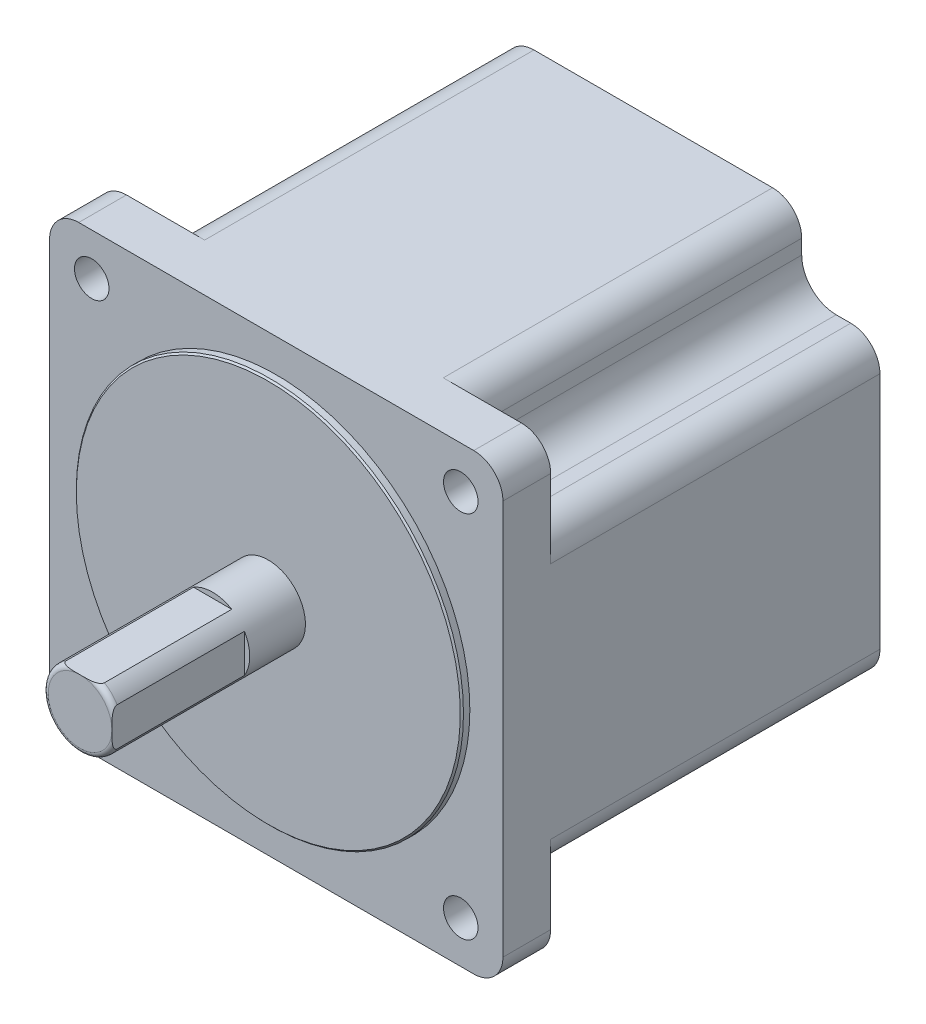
ISO-10303-21;
HEADER;
FILE_DESCRIPTION(('STEP AP214'),'2;1');
FILE_NAME('part.step','',(''),(''),'','','');
FILE_SCHEMA(('AUTOMOTIVE_DESIGN { 1 0 10303 214 1 1 1 1 }'));
ENDSEC;
DATA;
#1=APPLICATION_CONTEXT('core data for automotive mechanical design processes');
#2=APPLICATION_PROTOCOL_DEFINITION('international standard','automotive_design',2000,#1);
#3=PRODUCT_CONTEXT('',#1,'mechanical');
#4=PRODUCT('Part','Part','',(#3));
#5=PRODUCT_RELATED_PRODUCT_CATEGORY('part','',(#4));
#6=PRODUCT_DEFINITION_FORMATION('','',#4);
#7=PRODUCT_DEFINITION_CONTEXT('part definition',#1,'design');
#8=PRODUCT_DEFINITION('design','',#6,#7);
#9=PRODUCT_DEFINITION_SHAPE('','',#8);
#10=(LENGTH_UNIT() NAMED_UNIT(*) SI_UNIT(.MILLI.,.METRE.));
#11=(NAMED_UNIT(*) PLANE_ANGLE_UNIT() SI_UNIT($,.RADIAN.));
#12=(NAMED_UNIT(*) SI_UNIT($,.STERADIAN.) SOLID_ANGLE_UNIT());
#13=UNCERTAINTY_MEASURE_WITH_UNIT(LENGTH_MEASURE(1.E-05),#10,'distance_accuracy_value','');
#14=(GEOMETRIC_REPRESENTATION_CONTEXT(3) GLOBAL_UNCERTAINTY_ASSIGNED_CONTEXT((#13)) GLOBAL_UNIT_ASSIGNED_CONTEXT((#10,
#11,#12)) REPRESENTATION_CONTEXT('',''));
#15=CARTESIAN_POINT('',(0.,0.,0.));
#16=DIRECTION('',(0.,0.,1.));
#17=DIRECTION('',(1.,0.,0.));
#18=AXIS2_PLACEMENT_3D('',#15,#16,#17);
#19=CARTESIAN_POINT('',(0.,0.,35.5));
#20=DIRECTION('',(0.,0.,-1.));
#21=DIRECTION('',(-1.,0.,0.));
#22=AXIS2_PLACEMENT_3D('',#19,#20,#21);
#23=CYLINDRICAL_SURFACE('',#22,7.);
#24=CARTESIAN_POINT('',(0.,0.,0.));
#25=DIRECTION('',(0.,0.,-1.));
#26=DIRECTION('',(-1.,0.,0.));
#27=AXIS2_PLACEMENT_3D('',#24,#25,#26);
#28=CIRCLE('',#27,7.);
#29=CARTESIAN_POINT('',(-7.,0.,0.));
#30=VERTEX_POINT('',#29);
#31=EDGE_CURVE('E869',#30,#30,#28,.T.);
#32=ORIENTED_EDGE('',*,*,#31,.F.);
#33=EDGE_LOOP('',(#32));
#34=FACE_BOUND('',#33,.T.);
#35=CARTESIAN_POINT('',(0.,0.,34.5));
#36=DIRECTION('',(0.,0.,1.));
#37=DIRECTION('',(1.,0.,0.));
#38=AXIS2_PLACEMENT_3D('',#35,#36,#37);
#39=CIRCLE('',#38,7.);
#40=CARTESIAN_POINT('',(6.,-3.60555127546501,34.4999999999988));
#41=VERTEX_POINT('',#40);
#42=CARTESIAN_POINT('',(-3.60555127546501,6.,34.4999999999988));
#43=VERTEX_POINT('',#42);
#44=EDGE_CURVE('E330',#41,#43,#39,.F.);
#45=ORIENTED_EDGE('',*,*,#44,.T.);
#46=DIRECTION('',(0.,0.,-1.));
#47=VECTOR('',#46,1.);
#48=CARTESIAN_POINT('',(-3.60555127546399,6.,35.5));
#49=LINE('',#48,#47);
#50=CARTESIAN_POINT('',(-3.60555127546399,6.,10.5));
#51=VERTEX_POINT('',#50);
#52=EDGE_CURVE('E1403',#43,#51,#49,.T.);
#53=ORIENTED_EDGE('',*,*,#52,.T.);
#54=CARTESIAN_POINT('',(0.,0.,10.5));
#55=DIRECTION('',(0.,0.,1.));
#56=DIRECTION('',(1.,0.,0.));
#57=AXIS2_PLACEMENT_3D('',#54,#55,#56);
#58=CIRCLE('',#57,7.);
#59=CARTESIAN_POINT('',(3.60555127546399,6.,10.5));
#60=VERTEX_POINT('',#59);
#61=EDGE_CURVE('E1427',#60,#51,#58,.T.);
#62=ORIENTED_EDGE('',*,*,#61,.F.);
#63=DIRECTION('',(0.,0.,-1.));
#64=VECTOR('',#63,1.);
#65=CARTESIAN_POINT('',(3.60555127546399,6.,35.5));
#66=LINE('',#65,#64);
#67=CARTESIAN_POINT('',(3.60555127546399,6.,34.5));
#68=VERTEX_POINT('',#67);
#69=EDGE_CURVE('E1400',#60,#68,#66,.F.);
#70=ORIENTED_EDGE('',*,*,#69,.T.);
#71=CARTESIAN_POINT('',(6.,3.60555127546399,34.5));
#72=VERTEX_POINT('',#71);
#73=EDGE_CURVE('E347',#68,#72,#39,.F.);
#74=ORIENTED_EDGE('',*,*,#73,.T.);
#75=DIRECTION('',(0.,0.,-1.));
#76=VECTOR('',#75,1.);
#77=CARTESIAN_POINT('',(6.,3.60555127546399,35.5));
#78=LINE('',#77,#76);
#79=CARTESIAN_POINT('',(6.,3.60555127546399,10.5));
#80=VERTEX_POINT('',#79);
#81=EDGE_CURVE('E65',#80,#72,#78,.F.);
#82=ORIENTED_EDGE('',*,*,#81,.F.);
#83=CARTESIAN_POINT('',(6.,-3.60555127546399,10.5));
#84=VERTEX_POINT('',#83);
#85=EDGE_CURVE('E1429',#84,#80,#58,.T.);
#86=ORIENTED_EDGE('',*,*,#85,.F.);
#87=DIRECTION('',(0.,0.,-1.));
#88=VECTOR('',#87,1.);
#89=CARTESIAN_POINT('',(6.,-3.60555127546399,35.5));
#90=LINE('',#89,#88);
#91=EDGE_CURVE('E1398',#41,#84,#90,.T.);
#92=ORIENTED_EDGE('',*,*,#91,.F.);
#93=EDGE_LOOP('',(#45,#53,#62,#70,#74,#82,#86,#92));
#94=FACE_BOUND('',#93,.T.);
#95=ADVANCED_FACE('F42',(#34,#94),#23,.T.);
#96=CARTESIAN_POINT('',(0.,0.,34.5));
#97=DIRECTION('',(0.,0.,1.));
#98=DIRECTION('',(1.,0.,0.));
#99=AXIS2_PLACEMENT_3D('',#96,#97,#98);
#100=TOROIDAL_SURFACE('',#99,6.,1.);
#101=CARTESIAN_POINT('',(-3.60310285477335,6.,34.4498));
#102=CARTESIAN_POINT('',(-3.60606903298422,6.,34.4794230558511));
#103=CARTESIAN_POINT('',(-3.60634334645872,6.,34.5092692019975));
#104=CARTESIAN_POINT('',(-3.60183180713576,6.,34.5683743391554));
#105=CARTESIAN_POINT('',(-3.5970811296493,6.,34.5976359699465));
#106=CARTESIAN_POINT('',(-3.58288474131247,6.,34.6549369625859));
#107=CARTESIAN_POINT('',(-3.57344503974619,6.,34.6829778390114));
#108=CARTESIAN_POINT('',(-3.55053706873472,6.,34.7373798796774));
#109=CARTESIAN_POINT('',(-3.53706251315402,6.,34.7637383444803));
#110=CARTESIAN_POINT('',(-3.49911909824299,6.,34.8273406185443));
#111=CARTESIAN_POINT('',(-3.47254030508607,6.,34.8633245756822));
#112=CARTESIAN_POINT('',(-3.41403959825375,6.,34.930664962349));
#113=CARTESIAN_POINT('',(-3.38210229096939,6.,34.9620075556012));
#114=CARTESIAN_POINT('',(-3.29347227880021,6.,35.0386085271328));
#115=CARTESIAN_POINT('',(-3.23376530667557,6.,35.0803505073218));
#116=CARTESIAN_POINT('',(-3.10904816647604,6.,35.1545976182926));
#117=CARTESIAN_POINT('',(-3.04403268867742,6.,35.18709335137));
#118=CARTESIAN_POINT('',(-2.91093070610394,6.,35.2447829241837));
#119=CARTESIAN_POINT('',(-2.84284537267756,6.,35.269979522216));
#120=CARTESIAN_POINT('',(-2.70477563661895,6.,35.3145991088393));
#121=CARTESIAN_POINT('',(-2.6347892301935,6.,35.3340157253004));
#122=CARTESIAN_POINT('',(-2.4933113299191,6.,35.3683088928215));
#123=CARTESIAN_POINT('',(-2.42181350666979,6.,35.3831587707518));
#124=CARTESIAN_POINT('',(-2.27821414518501,6.,35.4090924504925));
#125=CARTESIAN_POINT('',(-2.20611314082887,6.,35.4201792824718));
#126=CARTESIAN_POINT('',(-2.0472037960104,6.,35.4412630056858));
#127=CARTESIAN_POINT('',(-1.96031085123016,6.,35.4506091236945));
#128=CARTESIAN_POINT('',(-1.78623141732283,6.,35.4660708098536));
#129=CARTESIAN_POINT('',(-1.69904486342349,6.,35.4721856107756));
#130=CARTESIAN_POINT('',(-1.52445988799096,6.,35.4820458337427));
#131=CARTESIAN_POINT('',(-1.43706134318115,6.,35.4857889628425));
#132=CARTESIAN_POINT('',(-1.26220665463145,6.,35.4916073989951));
#133=CARTESIAN_POINT('',(-1.17475050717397,6.,35.4936825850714));
#134=CARTESIAN_POINT('',(-0.999487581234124,6.,35.4967511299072));
#135=CARTESIAN_POINT('',(-0.911680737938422,6.,35.4977403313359));
#136=CARTESIAN_POINT('',(-0.736061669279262,6.,35.4990875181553));
#137=CARTESIAN_POINT('',(-0.648249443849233,6.,35.4994454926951));
#138=CARTESIAN_POINT('',(-0.472684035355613,6.,35.4998721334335));
#139=CARTESIAN_POINT('',(-0.384930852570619,6.,35.4999409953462));
#140=CARTESIAN_POINT('',(-0.209424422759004,6.,35.5000049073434));
#141=CARTESIAN_POINT('',(-0.121671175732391,6.,35.4999999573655));
#142=CARTESIAN_POINT('',(0.0534958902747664,6.,35.5000000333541));
#143=CARTESIAN_POINT('',(0.140909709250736,6.,35.5000050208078));
#144=CARTESIAN_POINT('',(0.31573730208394,6.,35.4999761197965));
#145=CARTESIAN_POINT('',(0.40315107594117,6.,35.499942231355));
#146=CARTESIAN_POINT('',(0.578031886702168,6.,35.4996567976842));
#147=CARTESIAN_POINT('',(0.66549892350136,6.,35.4994051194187));
#148=CARTESIAN_POINT('',(0.840429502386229,6.,35.4983788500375));
#149=CARTESIAN_POINT('',(0.927893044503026,6.,35.4976042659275));
#150=CARTESIAN_POINT('',(1.10251222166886,6.,35.4951097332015));
#151=CARTESIAN_POINT('',(1.18966789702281,6.,35.4933929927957));
#152=CARTESIAN_POINT('',(1.36393564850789,6.,35.4884754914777));
#153=CARTESIAN_POINT('',(1.4510477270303,6.,35.4852748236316));
#154=CARTESIAN_POINT('',(1.62510052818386,6.,35.4767270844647));
#155=CARTESIAN_POINT('',(1.71204133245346,6.,35.471381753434));
#156=CARTESIAN_POINT('',(1.8856863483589,6.,35.4577415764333));
#157=CARTESIAN_POINT('',(1.97239060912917,6.,35.4494473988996));
#158=CARTESIAN_POINT('',(2.10407408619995,6.,35.433817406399));
#159=CARTESIAN_POINT('',(2.14922335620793,6.,35.4279124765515));
#160=CARTESIAN_POINT('',(2.23935687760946,6.,35.4148544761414));
#161=CARTESIAN_POINT('',(2.28434107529,6.,35.4077010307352));
#162=CARTESIAN_POINT('',(2.37424904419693,6.,35.3919272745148));
#163=CARTESIAN_POINT('',(2.41917176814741,6.,35.3833009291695));
#164=CARTESIAN_POINT('',(2.50866395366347,6.,35.3643855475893));
#165=CARTESIAN_POINT('',(2.55323343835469,6.,35.3540966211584));
#166=CARTESIAN_POINT('',(2.65933979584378,6.,35.3271831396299));
#167=CARTESIAN_POINT('',(2.72065381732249,6.,35.309658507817));
#168=CARTESIAN_POINT('',(2.84189365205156,6.,35.2700713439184));
#169=CARTESIAN_POINT('',(2.9018180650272,6.,35.2480044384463));
#170=CARTESIAN_POINT('',(3.01892944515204,6.,35.1985144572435));
#171=CARTESIAN_POINT('',(3.07613337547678,6.,35.171132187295));
#172=CARTESIAN_POINT('',(3.1867963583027,6.,35.1097235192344));
#173=CARTESIAN_POINT('',(3.2402649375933,6.,35.0757149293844));
#174=CARTESIAN_POINT('',(3.32212583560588,6.,35.0139772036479));
#175=CARTESIAN_POINT('',(3.35237087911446,6.,34.988716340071));
#176=CARTESIAN_POINT('',(3.4096487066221,6.,34.9346946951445));
#177=CARTESIAN_POINT('',(3.43667963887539,6.,34.905931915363));
#178=CARTESIAN_POINT('',(3.48654628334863,6.,34.8443922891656));
#179=CARTESIAN_POINT('',(3.50933353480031,6.,34.8115754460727));
#180=CARTESIAN_POINT('',(3.54866231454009,6.,34.7423666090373));
#181=CARTESIAN_POINT('',(3.56521573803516,6.,34.7059815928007));
#182=CARTESIAN_POINT('',(3.58720258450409,6.,34.6400371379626));
#183=CARTESIAN_POINT('',(3.59438512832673,6.,34.6110603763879));
#184=CARTESIAN_POINT('',(3.60372793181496,6.,34.5523411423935));
#185=CARTESIAN_POINT('',(3.60589903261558,6.,34.5226004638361));
#186=CARTESIAN_POINT('',(3.60531020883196,6.,34.478514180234));
#187=CARTESIAN_POINT('',(3.60451304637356,6.,34.464123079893));
#188=CARTESIAN_POINT('',(3.60310285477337,6.,34.4498000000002));
#189=B_SPLINE_CURVE_WITH_KNOTS('',3,(#101,#102,#103,#104,#105,#106,#107,#108,#109,#110,#111,
#112,#113,#114,#115,#116,#117,#118,#119,#120,#121,#122,#123,#124,#125,#126,#127,#128,#129,#130,
#131,#132,#133,#134,#135,#136,#137,#138,#139,#140,#141,#142,#143,#144,#145,#146,#147,#148,#149,
#150,#151,#152,#153,#154,#155,#156,#157,#158,#159,#160,#161,#162,#163,#164,#165,#166,#167,#168,
#169,#170,#171,#172,#173,#174,#175,#176,#177,#178,#179,#180,#181,#182,#183,#184,#185,#186,#187,
#188),.UNSPECIFIED.,.F.,.F.,(4,2,2,2,2,2,2,2,2,2,2,2,2,2,2,2,2,2,2,2,2,2,2,2,2,2,2,2,2,2,2,2,2,
2,2,2,2,2,2,2,2,2,2,4),(0.,0.0891302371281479,0.177640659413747,0.266037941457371,
0.354573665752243,0.488015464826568,0.621847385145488,0.839168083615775,1.05670887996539,
1.27416736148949,1.49186469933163,1.71081040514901,1.92957938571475,2.19167726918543,
2.45383735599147,2.71625051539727,2.97868270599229,3.24211606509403,3.50555395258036,
3.76881347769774,4.03207322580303,4.29431468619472,4.55655598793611,4.8189575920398,
5.08135568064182,5.34286575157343,5.60435942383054,5.86564133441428,6.1268640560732,
6.26345130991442,6.40007964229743,6.5372818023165,6.67447490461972,6.86564045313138,
7.05699092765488,7.24692669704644,7.43635888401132,7.55435538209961,7.67241953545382,
7.79175876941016,7.91086911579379,8.00004527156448,8.08902833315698,8.13221435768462),.UNSPECIFIED.);
#190=CARTESIAN_POINT('',(0.,6.,35.5));
#191=VERTEX_POINT('',#190);
#192=EDGE_CURVE('E57',#43,#191,#189,.T.);
#193=ORIENTED_EDGE('',*,*,#192,.F.);
#194=ORIENTED_EDGE('',*,*,#44,.F.);
#195=CARTESIAN_POINT('',(6.,-3.60310285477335,34.4498));
#196=CARTESIAN_POINT('',(6.,-3.60606903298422,34.4794230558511));
#197=CARTESIAN_POINT('',(6.,-3.60634334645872,34.5092692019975));
#198=CARTESIAN_POINT('',(6.,-3.60183180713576,34.5683743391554));
#199=CARTESIAN_POINT('',(6.,-3.5970811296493,34.5976359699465));
#200=CARTESIAN_POINT('',(6.,-3.58288474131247,34.6549369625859));
#201=CARTESIAN_POINT('',(6.,-3.57344503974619,34.6829778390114));
#202=CARTESIAN_POINT('',(6.,-3.55053706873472,34.7373798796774));
#203=CARTESIAN_POINT('',(6.,-3.53706251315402,34.7637383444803));
#204=CARTESIAN_POINT('',(6.,-3.49911909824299,34.8273406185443));
#205=CARTESIAN_POINT('',(6.,-3.47254030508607,34.8633245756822));
#206=CARTESIAN_POINT('',(6.,-3.41403959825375,34.930664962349));
#207=CARTESIAN_POINT('',(6.,-3.38210229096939,34.9620075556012));
#208=CARTESIAN_POINT('',(6.,-3.29347227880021,35.0386085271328));
#209=CARTESIAN_POINT('',(6.,-3.23376530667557,35.0803505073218));
#210=CARTESIAN_POINT('',(6.,-3.10904816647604,35.1545976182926));
#211=CARTESIAN_POINT('',(6.,-3.04403268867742,35.18709335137));
#212=CARTESIAN_POINT('',(6.,-2.91093070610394,35.2447829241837));
#213=CARTESIAN_POINT('',(6.,-2.84284537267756,35.269979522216));
#214=CARTESIAN_POINT('',(6.,-2.70477563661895,35.3145991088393));
#215=CARTESIAN_POINT('',(6.,-2.6347892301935,35.3340157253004));
#216=CARTESIAN_POINT('',(6.,-2.4933113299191,35.3683088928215));
#217=CARTESIAN_POINT('',(6.,-2.42181350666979,35.3831587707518));
#218=CARTESIAN_POINT('',(6.,-2.27821414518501,35.4090924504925));
#219=CARTESIAN_POINT('',(6.,-2.20611314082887,35.4201792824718));
#220=CARTESIAN_POINT('',(6.,-2.0472037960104,35.4412630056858));
#221=CARTESIAN_POINT('',(6.,-1.96031085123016,35.4506091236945));
#222=CARTESIAN_POINT('',(6.,-1.78623141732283,35.4660708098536));
#223=CARTESIAN_POINT('',(6.,-1.69904486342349,35.4721856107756));
#224=CARTESIAN_POINT('',(6.,-1.52445988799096,35.4820458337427));
#225=CARTESIAN_POINT('',(6.,-1.43706134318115,35.4857889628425));
#226=CARTESIAN_POINT('',(6.,-1.26220665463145,35.4916073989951));
#227=CARTESIAN_POINT('',(6.,-1.17475050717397,35.4936825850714));
#228=CARTESIAN_POINT('',(6.,-0.999487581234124,35.4967511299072));
#229=CARTESIAN_POINT('',(6.,-0.911680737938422,35.4977403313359));
#230=CARTESIAN_POINT('',(6.,-0.736061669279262,35.4990875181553));
#231=CARTESIAN_POINT('',(6.,-0.648249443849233,35.4994454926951));
#232=CARTESIAN_POINT('',(6.,-0.472684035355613,35.4998721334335));
#233=CARTESIAN_POINT('',(6.,-0.384930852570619,35.4999409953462));
#234=CARTESIAN_POINT('',(6.,-0.209424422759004,35.5000049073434));
#235=CARTESIAN_POINT('',(6.,-0.121671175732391,35.4999999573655));
#236=CARTESIAN_POINT('',(6.,0.0534958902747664,35.5000000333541));
#237=CARTESIAN_POINT('',(6.,0.140909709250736,35.5000050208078));
#238=CARTESIAN_POINT('',(6.,0.31573730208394,35.4999761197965));
#239=CARTESIAN_POINT('',(6.,0.40315107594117,35.499942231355));
#240=CARTESIAN_POINT('',(6.,0.578031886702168,35.4996567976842));
#241=CARTESIAN_POINT('',(6.,0.66549892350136,35.4994051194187));
#242=CARTESIAN_POINT('',(6.,0.840429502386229,35.4983788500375));
#243=CARTESIAN_POINT('',(6.,0.927893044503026,35.4976042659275));
#244=CARTESIAN_POINT('',(6.,1.10251222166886,35.4951097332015));
#245=CARTESIAN_POINT('',(6.,1.18966789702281,35.4933929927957));
#246=CARTESIAN_POINT('',(6.,1.36393564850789,35.4884754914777));
#247=CARTESIAN_POINT('',(6.,1.4510477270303,35.4852748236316));
#248=CARTESIAN_POINT('',(6.,1.62510052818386,35.4767270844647));
#249=CARTESIAN_POINT('',(6.,1.71204133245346,35.471381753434));
#250=CARTESIAN_POINT('',(6.,1.8856863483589,35.4577415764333));
#251=CARTESIAN_POINT('',(6.,1.97239060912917,35.4494473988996));
#252=CARTESIAN_POINT('',(6.,2.10407408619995,35.433817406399));
#253=CARTESIAN_POINT('',(6.,2.14922335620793,35.4279124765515));
#254=CARTESIAN_POINT('',(6.,2.23935687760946,35.4148544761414));
#255=CARTESIAN_POINT('',(6.,2.28434107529,35.4077010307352));
#256=CARTESIAN_POINT('',(6.,2.37424904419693,35.3919272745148));
#257=CARTESIAN_POINT('',(6.,2.41917176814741,35.3833009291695));
#258=CARTESIAN_POINT('',(6.,2.50866395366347,35.3643855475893));
#259=CARTESIAN_POINT('',(6.,2.55323343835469,35.3540966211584));
#260=CARTESIAN_POINT('',(6.,2.65933979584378,35.3271831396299));
#261=CARTESIAN_POINT('',(6.,2.72065381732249,35.309658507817));
#262=CARTESIAN_POINT('',(6.,2.84189365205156,35.2700713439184));
#263=CARTESIAN_POINT('',(6.,2.9018180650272,35.2480044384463));
#264=CARTESIAN_POINT('',(6.,3.01892944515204,35.1985144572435));
#265=CARTESIAN_POINT('',(6.,3.07613337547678,35.171132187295));
#266=CARTESIAN_POINT('',(6.,3.1867963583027,35.1097235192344));
#267=CARTESIAN_POINT('',(6.,3.2402649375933,35.0757149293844));
#268=CARTESIAN_POINT('',(6.,3.32212583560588,35.0139772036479));
#269=CARTESIAN_POINT('',(6.,3.35237087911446,34.988716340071));
#270=CARTESIAN_POINT('',(6.,3.4096487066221,34.9346946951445));
#271=CARTESIAN_POINT('',(6.,3.43667963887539,34.905931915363));
#272=CARTESIAN_POINT('',(6.,3.48654628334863,34.8443922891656));
#273=CARTESIAN_POINT('',(6.,3.50933353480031,34.8115754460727));
#274=CARTESIAN_POINT('',(6.,3.54866231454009,34.7423666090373));
#275=CARTESIAN_POINT('',(6.,3.56521573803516,34.7059815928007));
#276=CARTESIAN_POINT('',(6.,3.58720258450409,34.6400371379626));
#277=CARTESIAN_POINT('',(6.,3.59438512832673,34.6110603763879));
#278=CARTESIAN_POINT('',(6.,3.60372793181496,34.5523411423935));
#279=CARTESIAN_POINT('',(6.,3.60589903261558,34.5226004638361));
#280=CARTESIAN_POINT('',(6.,3.60531020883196,34.478514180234));
#281=CARTESIAN_POINT('',(6.,3.60451304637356,34.464123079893));
#282=CARTESIAN_POINT('',(6.,3.60310285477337,34.4498000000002));
#283=B_SPLINE_CURVE_WITH_KNOTS('',3,(#195,#196,#197,#198,#199,#200,#201,#202,#203,#204,#205,
#206,#207,#208,#209,#210,#211,#212,#213,#214,#215,#216,#217,#218,#219,#220,#221,#222,#223,#224,
#225,#226,#227,#228,#229,#230,#231,#232,#233,#234,#235,#236,#237,#238,#239,#240,#241,#242,#243,
#244,#245,#246,#247,#248,#249,#250,#251,#252,#253,#254,#255,#256,#257,#258,#259,#260,#261,#262,
#263,#264,#265,#266,#267,#268,#269,#270,#271,#272,#273,#274,#275,#276,#277,#278,#279,#280,#281,
#282),.UNSPECIFIED.,.F.,.F.,(4,2,2,2,2,2,2,2,2,2,2,2,2,2,2,2,2,2,2,2,2,2,2,2,2,2,2,2,2,2,2,2,2,
2,2,2,2,2,2,2,2,2,2,4),(0.,0.0891302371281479,0.177640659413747,0.266037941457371,
0.354573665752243,0.488015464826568,0.621847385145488,0.839168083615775,1.05670887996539,
1.27416736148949,1.49186469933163,1.71081040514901,1.92957938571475,2.19167726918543,
2.45383735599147,2.71625051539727,2.97868270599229,3.24211606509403,3.50555395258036,
3.76881347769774,4.03207322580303,4.29431468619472,4.55655598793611,4.8189575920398,
5.08135568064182,5.34286575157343,5.60435942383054,5.86564133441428,6.1268640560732,
6.26345130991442,6.40007964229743,6.5372818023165,6.67447490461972,6.86564045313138,
7.05699092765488,7.24692669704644,7.43635888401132,7.55435538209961,7.67241953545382,
7.79175876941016,7.91086911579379,8.00004527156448,8.08902833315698,8.13221435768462),.UNSPECIFIED.);
#284=CARTESIAN_POINT('',(6.,-4.63767449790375E-07,35.5));
#285=VERTEX_POINT('',#284);
#286=EDGE_CURVE('E324',#41,#285,#283,.T.);
#287=ORIENTED_EDGE('',*,*,#286,.T.);
#288=CARTESIAN_POINT('',(0.,0.,35.5));
#289=DIRECTION('',(0.,0.,1.));
#290=DIRECTION('',(1.,0.,0.));
#291=AXIS2_PLACEMENT_3D('',#288,#289,#290);
#292=CIRCLE('',#291,6.);
#293=EDGE_CURVE('E337',#191,#285,#292,.T.);
#294=ORIENTED_EDGE('',*,*,#293,.F.);
#295=EDGE_LOOP('',(#193,#194,#287,#294));
#296=FACE_BOUND('',#295,.T.);
#297=ADVANCED_FACE('F336',(#296),#100,.T.);
#298=EDGE_CURVE('E340',#191,#68,#189,.T.);
#299=ORIENTED_EDGE('',*,*,#298,.F.);
#300=EDGE_CURVE('E343',#285,#191,#292,.T.);
#301=ORIENTED_EDGE('',*,*,#300,.F.);
#302=EDGE_CURVE('E321',#285,#72,#283,.T.);
#303=ORIENTED_EDGE('',*,*,#302,.T.);
#304=ORIENTED_EDGE('',*,*,#73,.F.);
#305=EDGE_LOOP('',(#299,#301,#303,#304));
#306=FACE_BOUND('',#305,.T.);
#307=ADVANCED_FACE('F346',(#306),#100,.T.);
#308=CARTESIAN_POINT('',(13.25,-54.75,-72.6));
#309=DIRECTION('',(-1.,0.,0.));
#310=DIRECTION('',(0.,0.,1.));
#311=AXIS2_PLACEMENT_3D('',#308,#309,#310);
#312=PLANE('',#311);
#313=DIRECTION('',(0.,0.,1.));
#314=VECTOR('',#313,1.);
#315=CARTESIAN_POINT('',(13.25,-49.75,-72.6));
#316=LINE('',#315,#314);
#317=CARTESIAN_POINT('',(13.25,-49.75,-70.1428571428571));
#318=VERTEX_POINT('',#317);
#319=CARTESIAN_POINT('',(13.25,-49.75,-51.6));
#320=VERTEX_POINT('',#319);
#321=EDGE_CURVE('E661',#318,#320,#316,.T.);
#322=ORIENTED_EDGE('',*,*,#321,.F.);
#323=DIRECTION('',(0.,0.631271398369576,-0.775562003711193));
#324=VECTOR('',#323,1.);
#325=CARTESIAN_POINT('',(13.25,-50.5395250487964,-69.1728692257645));
#326=LINE('',#325,#324);
#327=CARTESIAN_POINT('',(13.25,-47.75,-72.6));
#328=VERTEX_POINT('',#327);
#329=EDGE_CURVE('E667',#318,#328,#326,.T.);
#330=ORIENTED_EDGE('',*,*,#329,.T.);
#331=DIRECTION('',(0.,1.,0.));
#332=VECTOR('',#331,1.);
#333=CARTESIAN_POINT('',(13.25,-54.75,-72.6));
#334=LINE('',#333,#332);
#335=CARTESIAN_POINT('',(13.25,-42.75,-72.6));
#336=VERTEX_POINT('',#335);
#337=EDGE_CURVE('E696',#328,#336,#334,.T.);
#338=ORIENTED_EDGE('',*,*,#337,.T.);
#339=DIRECTION('',(0.,0.,1.));
#340=VECTOR('',#339,1.);
#341=CARTESIAN_POINT('',(13.25,-42.75,-72.6));
#342=LINE('',#341,#340);
#343=CARTESIAN_POINT('',(13.25,-42.75,-51.6));
#344=VERTEX_POINT('',#343);
#345=EDGE_CURVE('E690',#336,#344,#342,.T.);
#346=ORIENTED_EDGE('',*,*,#345,.T.);
#347=DIRECTION('',(0.,1.,0.));
#348=VECTOR('',#347,1.);
#349=CARTESIAN_POINT('',(13.25,-54.75,-51.6));
#350=LINE('',#349,#348);
#351=EDGE_CURVE('E670',#320,#344,#350,.T.);
#352=ORIENTED_EDGE('',*,*,#351,.F.);
#353=EDGE_LOOP('',(#322,#330,#338,#346,#352));
#354=FACE_BOUND('',#353,.T.);
#355=ADVANCED_FACE('F392',(#354),#312,.F.);
#356=CARTESIAN_POINT('',(-13.25,-54.75,-51.6));
#357=DIRECTION('',(0.,0.,-1.));
#358=DIRECTION('',(-1.,0.,0.));
#359=AXIS2_PLACEMENT_3D('',#356,#357,#358);
#360=PLANE('',#359);
#361=DIRECTION('',(0.754605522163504,0.656178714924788,0.));
#362=VECTOR('',#361,1.);
#363=CARTESIAN_POINT('',(30.3390742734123,-34.8899354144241,-51.6));
#364=LINE('',#363,#362);
#365=CARTESIAN_POINT('',(7.50000000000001,-54.75,-51.6));
#366=VERTEX_POINT('',#365);
#367=EDGE_CURVE('E1406',#366,#320,#364,.T.);
#368=ORIENTED_EDGE('',*,*,#367,.T.);
#369=ORIENTED_EDGE('',*,*,#351,.T.);
#370=DIRECTION('',(-1.,0.,0.));
#371=VECTOR('',#370,1.);
#372=CARTESIAN_POINT('',(-13.25,-42.75,-51.6));
#373=LINE('',#372,#371);
#374=CARTESIAN_POINT('',(-13.25,-42.75,-51.6));
#375=VERTEX_POINT('',#374);
#376=EDGE_CURVE('E687',#344,#375,#373,.T.);
#377=ORIENTED_EDGE('',*,*,#376,.T.);
#378=DIRECTION('',(0.,1.,0.));
#379=VECTOR('',#378,1.);
#380=CARTESIAN_POINT('',(-13.25,-54.75,-51.6));
#381=LINE('',#380,#379);
#382=CARTESIAN_POINT('',(-13.25,-49.75,-51.6));
#383=VERTEX_POINT('',#382);
#384=EDGE_CURVE('E686',#383,#375,#381,.T.);
#385=ORIENTED_EDGE('',*,*,#384,.F.);
#386=DIRECTION('',(-0.754605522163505,0.656178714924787,0.));
#387=VECTOR('',#386,1.);
#388=CARTESIAN_POINT('',(-30.3390742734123,-34.8899354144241,-51.6));
#389=LINE('',#388,#387);
#390=CARTESIAN_POINT('',(-7.49999999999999,-54.75,-51.6));
#391=VERTEX_POINT('',#390);
#392=EDGE_CURVE('E671',#391,#383,#389,.T.);
#393=ORIENTED_EDGE('',*,*,#392,.F.);
#394=DIRECTION('',(-1.,0.,0.));
#395=VECTOR('',#394,1.);
#396=CARTESIAN_POINT('',(-13.25,-54.75,-51.6));
#397=LINE('',#396,#395);
#398=EDGE_CURVE('E684',#366,#391,#397,.T.);
#399=ORIENTED_EDGE('',*,*,#398,.F.);
#400=EDGE_LOOP('',(#368,#369,#377,#385,#393,#399));
#401=FACE_BOUND('',#400,.T.);
#402=ADVANCED_FACE('F388',(#401),#360,.F.);
#403=CARTESIAN_POINT('',(0.,-54.75,0.));
#404=DIRECTION('',(0.,1.,0.));
#405=DIRECTION('',(0.,0.,1.));
#406=AXIS2_PLACEMENT_3D('',#403,#404,#405);
#407=PLANE('',#406);
#408=DIRECTION('',(0.,0.,1.));
#409=VECTOR('',#408,1.);
#410=CARTESIAN_POINT('',(7.50000000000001,-54.75,-72.6));
#411=LINE('',#410,#409);
#412=CARTESIAN_POINT('',(7.50000000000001,-54.75,-64.));
#413=VERTEX_POINT('',#412);
#414=EDGE_CURVE('E664',#413,#366,#411,.T.);
#415=ORIENTED_EDGE('',*,*,#414,.T.);
#416=ORIENTED_EDGE('',*,*,#398,.T.);
#417=DIRECTION('',(0.,0.,1.));
#418=VECTOR('',#417,1.);
#419=CARTESIAN_POINT('',(-7.49999999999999,-54.75,-72.6));
#420=LINE('',#419,#418);
#421=CARTESIAN_POINT('',(-7.5,-54.75,-64.));
#422=VERTEX_POINT('',#421);
#423=EDGE_CURVE('E1410',#422,#391,#420,.T.);
#424=ORIENTED_EDGE('',*,*,#423,.F.);
#425=DIRECTION('',(1.,0.,0.));
#426=VECTOR('',#425,1.);
#427=CARTESIAN_POINT('',(0.,-54.75,-64.));
#428=LINE('',#427,#426);
#429=EDGE_CURVE('E653',#422,#413,#428,.T.);
#430=ORIENTED_EDGE('',*,*,#429,.T.);
#431=EDGE_LOOP('',(#415,#416,#424,#430));
#432=FACE_BOUND('',#431,.T.);
#433=ADVANCED_FACE('F384',(#432),#407,.F.);
#434=CARTESIAN_POINT('',(-42.75,-47.75,-72.6));
#435=DIRECTION('',(0.,0.775562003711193,0.631271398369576));
#436=DIRECTION('',(0.,-0.631271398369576,0.775562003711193));
#437=AXIS2_PLACEMENT_3D('',#434,#435,#436);
#438=PLANE('',#437);
#439=DIRECTION('',(0.587477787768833,0.510850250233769,-0.627616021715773));
#440=VECTOR('',#439,1.);
#441=CARTESIAN_POINT('',(-4.57108781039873,-65.2465980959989,-51.1041794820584));
#442=LINE('',#441,#440);
#443=EDGE_CURVE('E344',#413,#318,#442,.T.);
#444=ORIENTED_EDGE('',*,*,#443,.F.);
#445=ORIENTED_EDGE('',*,*,#429,.F.);
#446=DIRECTION('',(-0.587477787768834,0.510850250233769,-0.627616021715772));
#447=VECTOR('',#446,1.);
#448=CARTESIAN_POINT('',(-24.937540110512,-39.5869216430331,-82.6289248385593));
#449=LINE('',#448,#447);
#450=CARTESIAN_POINT('',(-13.25,-49.75,-70.1428571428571));
#451=VERTEX_POINT('',#450);
#452=EDGE_CURVE('E655',#422,#451,#449,.T.);
#453=ORIENTED_EDGE('',*,*,#452,.T.);
#454=DIRECTION('',(0.,-0.631271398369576,0.775562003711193));
#455=VECTOR('',#454,1.);
#456=CARTESIAN_POINT('',(-13.25,-50.5395250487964,-69.1728692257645));
#457=LINE('',#456,#455);
#458=CARTESIAN_POINT('',(-13.25,-47.75,-72.6));
#459=VERTEX_POINT('',#458);
#460=EDGE_CURVE('E676',#459,#451,#457,.T.);
#461=ORIENTED_EDGE('',*,*,#460,.F.);
#462=DIRECTION('',(1.,0.,0.));
#463=VECTOR('',#462,1.);
#464=CARTESIAN_POINT('',(-42.75,-47.75,-72.6));
#465=LINE('',#464,#463);
#466=EDGE_CURVE('E674',#459,#328,#465,.T.);
#467=ORIENTED_EDGE('',*,*,#466,.T.);
#468=ORIENTED_EDGE('',*,*,#329,.F.);
#469=EDGE_LOOP('',(#444,#445,#453,#461,#467,#468));
#470=FACE_BOUND('',#469,.T.);
#471=ADVANCED_FACE('F380',(#470),#438,.F.);
#472=CARTESIAN_POINT('',(42.75,-42.75,-10.5));
#473=DIRECTION('',(0.,1.,0.));
#474=DIRECTION('',(0.,0.,1.));
#475=AXIS2_PLACEMENT_3D('',#472,#473,#474);
#476=PLANE('',#475);
#477=DIRECTION('',(0.,0.,-1.));
#478=VECTOR('',#477,1.);
#479=CARTESIAN_POINT('',(-13.25,-42.75,-72.6));
#480=LINE('',#479,#478);
#481=CARTESIAN_POINT('',(-13.25,-42.75,-72.6));
#482=VERTEX_POINT('',#481);
#483=EDGE_CURVE('E678',#375,#482,#480,.T.);
#484=ORIENTED_EDGE('',*,*,#483,.F.);
#485=ORIENTED_EDGE('',*,*,#376,.F.);
#486=ORIENTED_EDGE('',*,*,#345,.F.);
#487=DIRECTION('',(-1.,0.,0.));
#488=VECTOR('',#487,1.);
#489=CARTESIAN_POINT('',(0.,-42.75,-72.6));
#490=LINE('',#489,#488);
#491=CARTESIAN_POINT('',(22.5,-42.75,-72.6));
#492=VERTEX_POINT('',#491);
#493=EDGE_CURVE('E730',#492,#336,#490,.T.);
#494=ORIENTED_EDGE('',*,*,#493,.F.);
#495=DIRECTION('',(0.,0.,1.));
#496=VECTOR('',#495,1.);
#497=CARTESIAN_POINT('',(22.5,-42.75,-10.5));
#498=LINE('',#497,#496);
#499=CARTESIAN_POINT('',(22.5,-42.75,-10.5));
#500=VERTEX_POINT('',#499);
#501=EDGE_CURVE('E587',#492,#500,#498,.T.);
#502=ORIENTED_EDGE('',*,*,#501,.T.);
#503=DIRECTION('',(-1.,0.,0.));
#504=VECTOR('',#503,1.);
#505=CARTESIAN_POINT('',(42.75,-42.75,-10.5));
#506=LINE('',#505,#504);
#507=CARTESIAN_POINT('',(37.25,-42.75,-10.5));
#508=VERTEX_POINT('',#507);
#509=EDGE_CURVE('E846',#508,#500,#506,.T.);
#510=ORIENTED_EDGE('',*,*,#509,.F.);
#511=DIRECTION('',(0.,0.,1.));
#512=VECTOR('',#511,1.);
#513=CARTESIAN_POINT('',(37.25,-42.75,-10.5));
#514=LINE('',#513,#512);
#515=CARTESIAN_POINT('',(37.25,-42.75,-1.5));
#516=VERTEX_POINT('',#515);
#517=EDGE_CURVE('E881',#508,#516,#514,.T.);
#518=ORIENTED_EDGE('',*,*,#517,.T.);
#519=DIRECTION('',(-1.,0.,0.));
#520=VECTOR('',#519,1.);
#521=CARTESIAN_POINT('',(42.75,-42.75,-1.5));
#522=LINE('',#521,#520);
#523=CARTESIAN_POINT('',(-37.25,-42.75,-1.5));
#524=VERTEX_POINT('',#523);
#525=EDGE_CURVE('E877',#516,#524,#522,.T.);
#526=ORIENTED_EDGE('',*,*,#525,.T.);
#527=DIRECTION('',(0.,0.,1.));
#528=VECTOR('',#527,1.);
#529=CARTESIAN_POINT('',(-37.25,-42.75,-10.5));
#530=LINE('',#529,#528);
#531=CARTESIAN_POINT('',(-37.25,-42.75,-10.5));
#532=VERTEX_POINT('',#531);
#533=EDGE_CURVE('E874',#524,#532,#530,.F.);
#534=ORIENTED_EDGE('',*,*,#533,.T.);
#535=CARTESIAN_POINT('',(-22.5,-42.75,-10.5));
#536=VERTEX_POINT('',#535);
#537=EDGE_CURVE('E744',#536,#532,#506,.T.);
#538=ORIENTED_EDGE('',*,*,#537,.F.);
#539=DIRECTION('',(0.,0.,1.));
#540=VECTOR('',#539,1.);
#541=CARTESIAN_POINT('',(-22.5,-42.75,-72.6));
#542=LINE('',#541,#540);
#543=CARTESIAN_POINT('',(-22.5,-42.75,-72.6));
#544=VERTEX_POINT('',#543);
#545=EDGE_CURVE('E584',#536,#544,#542,.F.);
#546=ORIENTED_EDGE('',*,*,#545,.T.);
#547=EDGE_CURVE('E729',#482,#544,#490,.T.);
#548=ORIENTED_EDGE('',*,*,#547,.F.);
#549=EDGE_LOOP('',(#484,#485,#486,#494,#502,#510,#518,#526,#534,#538,#546,#548));
#550=FACE_BOUND('',#549,.T.);
#551=ADVANCED_FACE('F383',(#550),#476,.F.);
#552=CARTESIAN_POINT('',(-42.75,-42.75,-10.5));
#553=DIRECTION('',(0.,0.,-1.));
#554=DIRECTION('',(-1.,0.,0.));
#555=AXIS2_PLACEMENT_3D('',#552,#553,#554);
#556=PLANE('',#555);
#557=CARTESIAN_POINT('',(34.8,34.8,-10.5));
#558=DIRECTION('',(0.,0.,-1.));
#559=DIRECTION('',(-1.,0.,0.));
#560=AXIS2_PLACEMENT_3D('',#557,#558,#559);
#561=CIRCLE('',#560,3.25);
#562=CARTESIAN_POINT('',(31.55,34.8,-10.5));
#563=VERTEX_POINT('',#562);
#564=EDGE_CURVE('E935',#563,#563,#561,.T.);
#565=ORIENTED_EDGE('',*,*,#564,.F.);
#566=EDGE_LOOP('',(#565));
#567=FACE_BOUND('',#566,.T.);
#568=DIRECTION('',(0.,-1.,0.));
#569=VECTOR('',#568,1.);
#570=CARTESIAN_POINT('',(42.75,42.75,-10.5));
#571=LINE('',#570,#569);
#572=CARTESIAN_POINT('',(42.75,37.25,-10.5));
#573=VERTEX_POINT('',#572);
#574=CARTESIAN_POINT('',(42.75,22.5,-10.5));
#575=VERTEX_POINT('',#574);
#576=EDGE_CURVE('E780',#573,#575,#571,.T.);
#577=ORIENTED_EDGE('',*,*,#576,.T.);
#578=CARTESIAN_POINT('',(37.25,22.5,-10.5));
#579=DIRECTION('',(0.,0.,-1.));
#580=DIRECTION('',(-1.,0.,0.));
#581=AXIS2_PLACEMENT_3D('',#578,#579,#580);
#582=CIRCLE('',#581,5.5);
#583=CARTESIAN_POINT('',(37.25,28.,-10.5));
#584=VERTEX_POINT('',#583);
#585=EDGE_CURVE('E651',#575,#584,#582,.F.);
#586=ORIENTED_EDGE('',*,*,#585,.T.);
#587=DIRECTION('',(-1.,0.,0.));
#588=VECTOR('',#587,1.);
#589=CARTESIAN_POINT('',(0.,28.,-10.5));
#590=LINE('',#589,#588);
#591=CARTESIAN_POINT('',(34.5,28.,-10.5));
#592=VERTEX_POINT('',#591);
#593=EDGE_CURVE('E627',#584,#592,#590,.T.);
#594=ORIENTED_EDGE('',*,*,#593,.T.);
#595=CARTESIAN_POINT('',(34.5,34.5,-10.5));
#596=DIRECTION('',(0.,0.,-1.));
#597=DIRECTION('',(-1.,0.,0.));
#598=AXIS2_PLACEMENT_3D('',#595,#596,#597);
#599=CIRCLE('',#598,6.5);
#600=CARTESIAN_POINT('',(28.,34.5,-10.5));
#601=VERTEX_POINT('',#600);
#602=EDGE_CURVE('E819',#592,#601,#599,.T.);
#603=ORIENTED_EDGE('',*,*,#602,.T.);
#604=DIRECTION('',(0.,-1.,0.));
#605=VECTOR('',#604,1.);
#606=CARTESIAN_POINT('',(28.,0.,-10.5));
#607=LINE('',#606,#605);
#608=CARTESIAN_POINT('',(28.,37.25,-10.5));
#609=VERTEX_POINT('',#608);
#610=EDGE_CURVE('E614',#609,#601,#607,.T.);
#611=ORIENTED_EDGE('',*,*,#610,.F.);
#612=CARTESIAN_POINT('',(22.5,37.25,-10.5));
#613=DIRECTION('',(0.,0.,-1.));
#614=DIRECTION('',(-1.,0.,0.));
#615=AXIS2_PLACEMENT_3D('',#612,#613,#614);
#616=CIRCLE('',#615,5.5);
#617=CARTESIAN_POINT('',(22.5,42.75,-10.5));
#618=VERTEX_POINT('',#617);
#619=EDGE_CURVE('E648',#609,#618,#616,.F.);
#620=ORIENTED_EDGE('',*,*,#619,.T.);
#621=DIRECTION('',(1.,0.,0.));
#622=VECTOR('',#621,1.);
#623=CARTESIAN_POINT('',(42.75,42.75,-10.5));
#624=LINE('',#623,#622);
#625=CARTESIAN_POINT('',(37.25,42.75,-10.5));
#626=VERTEX_POINT('',#625);
#627=EDGE_CURVE('E764',#618,#626,#624,.T.);
#628=ORIENTED_EDGE('',*,*,#627,.T.);
#629=CARTESIAN_POINT('',(37.25,37.25,-10.5));
#630=DIRECTION('',(0.,0.,-1.));
#631=DIRECTION('',(-1.,0.,0.));
#632=AXIS2_PLACEMENT_3D('',#629,#630,#631);
#633=CIRCLE('',#632,5.5);
#634=EDGE_CURVE('E843',#626,#573,#633,.T.);
#635=ORIENTED_EDGE('',*,*,#634,.T.);
#636=EDGE_LOOP('',(#577,#586,#594,#603,#611,#620,#628,#635));
#637=FACE_BOUND('',#636,.T.);
#638=ADVANCED_FACE('F463',(#567,#637),#556,.T.);
#639=CARTESIAN_POINT('',(-34.8,34.8,-10.5));
#640=DIRECTION('',(0.,0.,-1.));
#641=DIRECTION('',(-1.,0.,0.));
#642=AXIS2_PLACEMENT_3D('',#639,#640,#641);
#643=CIRCLE('',#642,3.25);
#644=CARTESIAN_POINT('',(-38.05,34.8,-10.5));
#645=VERTEX_POINT('',#644);
#646=EDGE_CURVE('E928',#645,#645,#643,.T.);
#647=ORIENTED_EDGE('',*,*,#646,.F.);
#648=EDGE_LOOP('',(#647));
#649=FACE_BOUND('',#648,.T.);
#650=CARTESIAN_POINT('',(-37.25,42.75,-10.5));
#651=VERTEX_POINT('',#650);
#652=CARTESIAN_POINT('',(-22.5,42.75,-10.5));
#653=VERTEX_POINT('',#652);
#654=EDGE_CURVE('E848',#651,#653,#624,.T.);
#655=ORIENTED_EDGE('',*,*,#654,.T.);
#656=CARTESIAN_POINT('',(-22.5,37.25,-10.5));
#657=DIRECTION('',(0.,0.,-1.));
#658=DIRECTION('',(-1.,0.,0.));
#659=AXIS2_PLACEMENT_3D('',#656,#657,#658);
#660=CIRCLE('',#659,5.5);
#661=CARTESIAN_POINT('',(-28.,37.25,-10.5));
#662=VERTEX_POINT('',#661);
#663=EDGE_CURVE('E646',#653,#662,#660,.F.);
#664=ORIENTED_EDGE('',*,*,#663,.T.);
#665=DIRECTION('',(0.,-1.,0.));
#666=VECTOR('',#665,1.);
#667=CARTESIAN_POINT('',(-28.,0.,-10.5));
#668=LINE('',#667,#666);
#669=CARTESIAN_POINT('',(-28.,34.5,-10.5));
#670=VERTEX_POINT('',#669);
#671=EDGE_CURVE('E611',#662,#670,#668,.T.);
#672=ORIENTED_EDGE('',*,*,#671,.T.);
#673=CARTESIAN_POINT('',(-34.5,34.5,-10.5));
#674=DIRECTION('',(0.,0.,-1.));
#675=DIRECTION('',(-1.,0.,0.));
#676=AXIS2_PLACEMENT_3D('',#673,#674,#675);
#677=CIRCLE('',#676,6.5);
#678=CARTESIAN_POINT('',(-34.5,28.,-10.5));
#679=VERTEX_POINT('',#678);
#680=EDGE_CURVE('E812',#670,#679,#677,.T.);
#681=ORIENTED_EDGE('',*,*,#680,.T.);
#682=DIRECTION('',(-1.,0.,0.));
#683=VECTOR('',#682,1.);
#684=CARTESIAN_POINT('',(0.,28.,-10.5));
#685=LINE('',#684,#683);
#686=CARTESIAN_POINT('',(-37.25,28.,-10.5));
#687=VERTEX_POINT('',#686);
#688=EDGE_CURVE('E615',#679,#687,#685,.T.);
#689=ORIENTED_EDGE('',*,*,#688,.T.);
#690=CARTESIAN_POINT('',(-37.25,22.5,-10.5));
#691=DIRECTION('',(0.,0.,-1.));
#692=DIRECTION('',(-1.,0.,0.));
#693=AXIS2_PLACEMENT_3D('',#690,#691,#692);
#694=CIRCLE('',#693,5.5);
#695=CARTESIAN_POINT('',(-42.75,22.5,-10.5));
#696=VERTEX_POINT('',#695);
#697=EDGE_CURVE('E643',#687,#696,#694,.F.);
#698=ORIENTED_EDGE('',*,*,#697,.T.);
#699=DIRECTION('',(0.,1.,0.));
#700=VECTOR('',#699,1.);
#701=CARTESIAN_POINT('',(-42.75,42.75,-10.5));
#702=LINE('',#701,#700);
#703=CARTESIAN_POINT('',(-42.75,37.25,-10.5));
#704=VERTEX_POINT('',#703);
#705=EDGE_CURVE('E943',#696,#704,#702,.T.);
#706=ORIENTED_EDGE('',*,*,#705,.T.);
#707=CARTESIAN_POINT('',(-37.25,37.25,-10.5));
#708=DIRECTION('',(0.,0.,-1.));
#709=DIRECTION('',(-1.,0.,0.));
#710=AXIS2_PLACEMENT_3D('',#707,#708,#709);
#711=CIRCLE('',#710,5.5);
#712=EDGE_CURVE('E898',#704,#651,#711,.T.);
#713=ORIENTED_EDGE('',*,*,#712,.T.);
#714=EDGE_LOOP('',(#655,#664,#672,#681,#689,#698,#706,#713));
#715=FACE_BOUND('',#714,.T.);
#716=ADVANCED_FACE('F967',(#649,#715),#556,.T.);
#717=CARTESIAN_POINT('',(-34.8,-34.8,-10.5));
#718=DIRECTION('',(0.,0.,-1.));
#719=DIRECTION('',(-1.,0.,0.));
#720=AXIS2_PLACEMENT_3D('',#717,#718,#719);
#721=CIRCLE('',#720,3.25);
#722=CARTESIAN_POINT('',(-38.05,-34.8,-10.5));
#723=VERTEX_POINT('',#722);
#724=EDGE_CURVE('E991',#723,#723,#721,.T.);
#725=ORIENTED_EDGE('',*,*,#724,.F.);
#726=EDGE_LOOP('',(#725));
#727=FACE_BOUND('',#726,.T.);
#728=DIRECTION('',(-1.,0.,0.));
#729=VECTOR('',#728,1.);
#730=CARTESIAN_POINT('',(0.,-28.,-10.5));
#731=LINE('',#730,#729);
#732=CARTESIAN_POINT('',(-34.5,-28.,-10.5));
#733=VERTEX_POINT('',#732);
#734=CARTESIAN_POINT('',(-37.25,-28.,-10.5));
#735=VERTEX_POINT('',#734);
#736=EDGE_CURVE('E752',#733,#735,#731,.T.);
#737=ORIENTED_EDGE('',*,*,#736,.F.);
#738=CARTESIAN_POINT('',(-34.5,-34.5,-10.5));
#739=DIRECTION('',(0.,0.,-1.));
#740=DIRECTION('',(-1.,0.,0.));
#741=AXIS2_PLACEMENT_3D('',#738,#739,#740);
#742=CIRCLE('',#741,6.5);
#743=CARTESIAN_POINT('',(-28.,-34.5,-10.5));
#744=VERTEX_POINT('',#743);
#745=EDGE_CURVE('E751',#733,#744,#742,.T.);
#746=ORIENTED_EDGE('',*,*,#745,.T.);
#747=DIRECTION('',(0.,-1.,0.));
#748=VECTOR('',#747,1.);
#749=CARTESIAN_POINT('',(-28.,0.,-10.5));
#750=LINE('',#749,#748);
#751=CARTESIAN_POINT('',(-28.,-37.25,-10.5));
#752=VERTEX_POINT('',#751);
#753=EDGE_CURVE('E700',#744,#752,#750,.T.);
#754=ORIENTED_EDGE('',*,*,#753,.T.);
#755=CARTESIAN_POINT('',(-22.5,-37.25,-10.5));
#756=DIRECTION('',(0.,0.,-1.));
#757=DIRECTION('',(-1.,0.,0.));
#758=AXIS2_PLACEMENT_3D('',#755,#756,#757);
#759=CIRCLE('',#758,5.5);
#760=EDGE_CURVE('E638',#752,#536,#759,.F.);
#761=ORIENTED_EDGE('',*,*,#760,.T.);
#762=ORIENTED_EDGE('',*,*,#537,.T.);
#763=CARTESIAN_POINT('',(-37.25,-37.25,-10.5));
#764=DIRECTION('',(0.,0.,-1.));
#765=DIRECTION('',(-1.,0.,0.));
#766=AXIS2_PLACEMENT_3D('',#763,#764,#765);
#767=CIRCLE('',#766,5.5);
#768=CARTESIAN_POINT('',(-42.75,-37.25,-10.5));
#769=VERTEX_POINT('',#768);
#770=EDGE_CURVE('E900',#532,#769,#767,.T.);
#771=ORIENTED_EDGE('',*,*,#770,.T.);
#772=CARTESIAN_POINT('',(-42.75,-22.5,-10.5));
#773=VERTEX_POINT('',#772);
#774=EDGE_CURVE('E944',#769,#773,#702,.T.);
#775=ORIENTED_EDGE('',*,*,#774,.T.);
#776=CARTESIAN_POINT('',(-37.25,-22.5,-10.5));
#777=DIRECTION('',(0.,0.,-1.));
#778=DIRECTION('',(-1.,0.,0.));
#779=AXIS2_PLACEMENT_3D('',#776,#777,#778);
#780=CIRCLE('',#779,5.5);
#781=EDGE_CURVE('E641',#773,#735,#780,.F.);
#782=ORIENTED_EDGE('',*,*,#781,.T.);
#783=EDGE_LOOP('',(#737,#746,#754,#761,#762,#771,#775,#782));
#784=FACE_BOUND('',#783,.T.);
#785=ADVANCED_FACE('F464',(#727,#784),#556,.T.);
#786=CARTESIAN_POINT('',(0.,0.,35.5));
#787=DIRECTION('',(0.,0.,1.));
#788=DIRECTION('',(1.,0.,0.));
#789=AXIS2_PLACEMENT_3D('',#786,#787,#788);
#790=PLANE('',#789);
#791=ORIENTED_EDGE('',*,*,#300,.T.);
#792=ORIENTED_EDGE('',*,*,#293,.T.);
#793=EDGE_LOOP('',(#791,#792));
#794=FACE_BOUND('',#793,.T.);
#795=ADVANCED_FACE('F342',(#794),#790,.T.);
#796=CARTESIAN_POINT('',(0.,0.,0.));
#797=DIRECTION('',(0.,0.,-1.));
#798=DIRECTION('',(-1.,0.,0.));
#799=AXIS2_PLACEMENT_3D('',#796,#797,#798);
#800=PLANE('',#799);
#801=CARTESIAN_POINT('',(0.,0.,0.));
#802=DIRECTION('',(0.,0.,-1.));
#803=DIRECTION('',(-1.,0.,0.));
#804=AXIS2_PLACEMENT_3D('',#801,#802,#803);
#805=CIRCLE('',#804,36.2125);
#806=CARTESIAN_POINT('',(-36.2125,0.,0.));
#807=VERTEX_POINT('',#806);
#808=EDGE_CURVE('E50',#807,#807,#805,.F.);
#809=ORIENTED_EDGE('',*,*,#808,.T.);
#810=EDGE_LOOP('',(#809));
#811=FACE_BOUND('',#810,.T.);
#812=ORIENTED_EDGE('',*,*,#31,.T.);
#813=EDGE_LOOP('',(#812));
#814=FACE_BOUND('',#813,.T.);
#815=ADVANCED_FACE('F482',(#811,#814),#800,.F.);
#816=CARTESIAN_POINT('',(0.,0.,-1.5));
#817=DIRECTION('',(0.,0.,1.));
#818=DIRECTION('',(1.,0.,0.));
#819=AXIS2_PLACEMENT_3D('',#816,#817,#818);
#820=CYLINDRICAL_SURFACE('',#819,36.5125);
#821=CARTESIAN_POINT('',(0.,0.,-0.300000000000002));
#822=DIRECTION('',(0.,0.,-1.));
#823=DIRECTION('',(-1.,0.,0.));
#824=AXIS2_PLACEMENT_3D('',#821,#822,#823);
#825=CIRCLE('',#824,36.5125);
#826=CARTESIAN_POINT('',(-36.5125,0.,-0.300000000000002));
#827=VERTEX_POINT('',#826);
#828=EDGE_CURVE('E1441',#827,#827,#825,.T.);
#829=ORIENTED_EDGE('',*,*,#828,.T.);
#830=EDGE_LOOP('',(#829));
#831=FACE_BOUND('',#830,.T.);
#832=CARTESIAN_POINT('',(0.,0.,-1.5));
#833=DIRECTION('',(0.,0.,-1.));
#834=DIRECTION('',(-1.,0.,0.));
#835=AXIS2_PLACEMENT_3D('',#832,#833,#834);
#836=CIRCLE('',#835,36.5125);
#837=CARTESIAN_POINT('',(-36.5125,0.,-1.5));
#838=VERTEX_POINT('',#837);
#839=EDGE_CURVE('E865',#838,#838,#836,.T.);
#840=ORIENTED_EDGE('',*,*,#839,.F.);
#841=EDGE_LOOP('',(#840));
#842=FACE_BOUND('',#841,.T.);
#843=ADVANCED_FACE('F467',(#831,#842),#820,.T.);
#844=CARTESIAN_POINT('',(-42.75,-42.75,-1.5));
#845=DIRECTION('',(0.,0.,-1.));
#846=DIRECTION('',(-1.,0.,0.));
#847=AXIS2_PLACEMENT_3D('',#844,#845,#846);
#848=PLANE('',#847);
#849=CARTESIAN_POINT('',(34.8,-34.8,-1.5));
#850=DIRECTION('',(0.,0.,-1.));
#851=DIRECTION('',(-1.,0.,0.));
#852=AXIS2_PLACEMENT_3D('',#849,#850,#851);
#853=CIRCLE('',#852,3.25);
#854=CARTESIAN_POINT('',(31.55,-34.8,-1.5));
#855=VERTEX_POINT('',#854);
#856=EDGE_CURVE('E732',#855,#855,#853,.T.);
#857=ORIENTED_EDGE('',*,*,#856,.T.);
#858=EDGE_LOOP('',(#857));
#859=FACE_BOUND('',#858,.T.);
#860=CARTESIAN_POINT('',(34.8,34.8,-1.5));
#861=DIRECTION('',(0.,0.,-1.));
#862=DIRECTION('',(-1.,0.,0.));
#863=AXIS2_PLACEMENT_3D('',#860,#861,#862);
#864=CIRCLE('',#863,3.25);
#865=CARTESIAN_POINT('',(31.55,34.8,-1.5));
#866=VERTEX_POINT('',#865);
#867=EDGE_CURVE('E938',#866,#866,#864,.T.);
#868=ORIENTED_EDGE('',*,*,#867,.T.);
#869=EDGE_LOOP('',(#868));
#870=FACE_BOUND('',#869,.T.);
#871=ORIENTED_EDGE('',*,*,#525,.F.);
#872=CARTESIAN_POINT('',(37.25,-37.25,-1.5));
#873=DIRECTION('',(0.,0.,-1.));
#874=DIRECTION('',(-1.,0.,0.));
#875=AXIS2_PLACEMENT_3D('',#872,#873,#874);
#876=CIRCLE('',#875,5.5);
#877=CARTESIAN_POINT('',(42.75,-37.25,-1.5));
#878=VERTEX_POINT('',#877);
#879=EDGE_CURVE('E890',#516,#878,#876,.F.);
#880=ORIENTED_EDGE('',*,*,#879,.T.);
#881=DIRECTION('',(0.,-1.,0.));
#882=VECTOR('',#881,1.);
#883=CARTESIAN_POINT('',(42.75,42.75,-1.5));
#884=LINE('',#883,#882);
#885=CARTESIAN_POINT('',(42.75,37.25,-1.5));
#886=VERTEX_POINT('',#885);
#887=EDGE_CURVE('E926',#886,#878,#884,.T.);
#888=ORIENTED_EDGE('',*,*,#887,.F.);
#889=CARTESIAN_POINT('',(37.25,37.25,-1.5));
#890=DIRECTION('',(0.,0.,-1.));
#891=DIRECTION('',(-1.,0.,0.));
#892=AXIS2_PLACEMENT_3D('',#889,#890,#891);
#893=CIRCLE('',#892,5.5);
#894=CARTESIAN_POINT('',(37.25,42.75,-1.5));
#895=VERTEX_POINT('',#894);
#896=EDGE_CURVE('E884',#886,#895,#893,.F.);
#897=ORIENTED_EDGE('',*,*,#896,.T.);
#898=DIRECTION('',(1.,0.,0.));
#899=VECTOR('',#898,1.);
#900=CARTESIAN_POINT('',(42.75,42.75,-1.5));
#901=LINE('',#900,#899);
#902=CARTESIAN_POINT('',(-37.25,42.75,-1.5));
#903=VERTEX_POINT('',#902);
#904=EDGE_CURVE('E918',#903,#895,#901,.T.);
#905=ORIENTED_EDGE('',*,*,#904,.F.);
#906=CARTESIAN_POINT('',(-37.25,37.25,-1.5));
#907=DIRECTION('',(0.,0.,-1.));
#908=DIRECTION('',(-1.,0.,0.));
#909=AXIS2_PLACEMENT_3D('',#906,#907,#908);
#910=CIRCLE('',#909,5.5);
#911=CARTESIAN_POINT('',(-42.75,37.25,-1.5));
#912=VERTEX_POINT('',#911);
#913=EDGE_CURVE('E886',#903,#912,#910,.F.);
#914=ORIENTED_EDGE('',*,*,#913,.T.);
#915=DIRECTION('',(0.,1.,0.));
#916=VECTOR('',#915,1.);
#917=CARTESIAN_POINT('',(-42.75,42.75,-1.5));
#918=LINE('',#917,#916);
#919=CARTESIAN_POINT('',(-42.75,-37.25,-1.5));
#920=VERTEX_POINT('',#919);
#921=EDGE_CURVE('E861',#920,#912,#918,.T.);
#922=ORIENTED_EDGE('',*,*,#921,.F.);
#923=CARTESIAN_POINT('',(-37.25,-37.25,-1.5));
#924=DIRECTION('',(0.,0.,-1.));
#925=DIRECTION('',(-1.,0.,0.));
#926=AXIS2_PLACEMENT_3D('',#923,#924,#925);
#927=CIRCLE('',#926,5.5);
#928=EDGE_CURVE('E888',#920,#524,#927,.F.);
#929=ORIENTED_EDGE('',*,*,#928,.T.);
#930=EDGE_LOOP('',(#871,#880,#888,#897,#905,#914,#922,#929));
#931=FACE_BOUND('',#930,.T.);
#932=CARTESIAN_POINT('',(-34.8,34.8,-1.5));
#933=DIRECTION('',(0.,0.,-1.));
#934=DIRECTION('',(-1.,0.,0.));
#935=AXIS2_PLACEMENT_3D('',#932,#933,#934);
#936=CIRCLE('',#935,3.25);
#937=CARTESIAN_POINT('',(-38.05,34.8,-1.5));
#938=VERTEX_POINT('',#937);
#939=EDGE_CURVE('E931',#938,#938,#936,.T.);
#940=ORIENTED_EDGE('',*,*,#939,.T.);
#941=EDGE_LOOP('',(#940));
#942=FACE_BOUND('',#941,.T.);
#943=CARTESIAN_POINT('',(-34.8,-34.8,-1.5));
#944=DIRECTION('',(0.,0.,-1.));
#945=DIRECTION('',(-1.,0.,0.));
#946=AXIS2_PLACEMENT_3D('',#943,#944,#945);
#947=CIRCLE('',#946,3.25);
#948=CARTESIAN_POINT('',(-38.05,-34.8,-1.5));
#949=VERTEX_POINT('',#948);
#950=EDGE_CURVE('E993',#949,#949,#947,.T.);
#951=ORIENTED_EDGE('',*,*,#950,.T.);
#952=EDGE_LOOP('',(#951));
#953=FACE_BOUND('',#952,.T.);
#954=ORIENTED_EDGE('',*,*,#839,.T.);
#955=EDGE_LOOP('',(#954));
#956=FACE_BOUND('',#955,.T.);
#957=ADVANCED_FACE('F461',(#859,#870,#931,#942,#953,#956),#848,.F.);
#958=DIRECTION('',(0.,-1.,0.));
#959=VECTOR('',#958,1.);
#960=CARTESIAN_POINT('',(28.,0.,-10.5));
#961=LINE('',#960,#959);
#962=CARTESIAN_POINT('',(28.,-34.5,-10.5));
#963=VERTEX_POINT('',#962);
#964=CARTESIAN_POINT('',(28.,-37.25,-10.5));
#965=VERTEX_POINT('',#964);
#966=EDGE_CURVE('E705',#963,#965,#961,.T.);
#967=ORIENTED_EDGE('',*,*,#966,.F.);
#968=CARTESIAN_POINT('',(34.5,-34.5,-10.5));
#969=DIRECTION('',(0.,0.,-1.));
#970=DIRECTION('',(-1.,0.,0.));
#971=AXIS2_PLACEMENT_3D('',#968,#969,#970);
#972=CIRCLE('',#971,6.5);
#973=CARTESIAN_POINT('',(34.5,-28.,-10.5));
#974=VERTEX_POINT('',#973);
#975=EDGE_CURVE('E791',#963,#974,#972,.T.);
#976=ORIENTED_EDGE('',*,*,#975,.T.);
#977=DIRECTION('',(-1.,0.,0.));
#978=VECTOR('',#977,1.);
#979=CARTESIAN_POINT('',(0.,-28.,-10.5));
#980=LINE('',#979,#978);
#981=CARTESIAN_POINT('',(37.25,-28.,-10.5));
#982=VERTEX_POINT('',#981);
#983=EDGE_CURVE('E630',#982,#974,#980,.T.);
#984=ORIENTED_EDGE('',*,*,#983,.F.);
#985=CARTESIAN_POINT('',(37.25,-22.5,-10.5));
#986=DIRECTION('',(0.,0.,-1.));
#987=DIRECTION('',(-1.,0.,0.));
#988=AXIS2_PLACEMENT_3D('',#985,#986,#987);
#989=CIRCLE('',#988,5.5);
#990=CARTESIAN_POINT('',(42.75,-22.5,-10.5));
#991=VERTEX_POINT('',#990);
#992=EDGE_CURVE('E633',#982,#991,#989,.F.);
#993=ORIENTED_EDGE('',*,*,#992,.T.);
#994=CARTESIAN_POINT('',(42.75,-37.25,-10.5));
#995=VERTEX_POINT('',#994);
#996=EDGE_CURVE('E844',#991,#995,#571,.T.);
#997=ORIENTED_EDGE('',*,*,#996,.T.);
#998=CARTESIAN_POINT('',(37.25,-37.25,-10.5));
#999=DIRECTION('',(0.,0.,-1.));
#1000=DIRECTION('',(-1.,0.,0.));
#1001=AXIS2_PLACEMENT_3D('',#998,#999,#1000);
#1002=CIRCLE('',#1001,5.5);
#1003=EDGE_CURVE('E902',#995,#508,#1002,.T.);
#1004=ORIENTED_EDGE('',*,*,#1003,.T.);
#1005=ORIENTED_EDGE('',*,*,#509,.T.);
#1006=CARTESIAN_POINT('',(22.5,-37.25,-10.5));
#1007=DIRECTION('',(0.,0.,-1.));
#1008=DIRECTION('',(-1.,0.,0.));
#1009=AXIS2_PLACEMENT_3D('',#1006,#1007,#1008);
#1010=CIRCLE('',#1009,5.5);
#1011=EDGE_CURVE('E636',#500,#965,#1010,.F.);
#1012=ORIENTED_EDGE('',*,*,#1011,.T.);
#1013=EDGE_LOOP('',(#967,#976,#984,#993,#997,#1004,#1005,#1012));
#1014=FACE_BOUND('',#1013,.T.);
#1015=CARTESIAN_POINT('',(34.8,-34.8,-10.5));
#1016=DIRECTION('',(0.,0.,-1.));
#1017=DIRECTION('',(-1.,0.,0.));
#1018=AXIS2_PLACEMENT_3D('',#1015,#1016,#1017);
#1019=CIRCLE('',#1018,3.25);
#1020=CARTESIAN_POINT('',(31.55,-34.8,-10.5));
#1021=VERTEX_POINT('',#1020);
#1022=EDGE_CURVE('E735',#1021,#1021,#1019,.T.);
#1023=ORIENTED_EDGE('',*,*,#1022,.F.);
#1024=EDGE_LOOP('',(#1023));
#1025=FACE_BOUND('',#1024,.T.);
#1026=ADVANCED_FACE('F457',(#1014,#1025),#556,.T.);
#1027=CARTESIAN_POINT('',(-42.75,42.75,-10.5));
#1028=DIRECTION('',(1.,0.,0.));
#1029=DIRECTION('',(0.,1.,0.));
#1030=AXIS2_PLACEMENT_3D('',#1027,#1028,#1029);
#1031=PLANE('',#1030);
#1032=DIRECTION('',(0.,1.,0.));
#1033=VECTOR('',#1032,1.);
#1034=CARTESIAN_POINT('',(-42.75,0.,-72.6));
#1035=LINE('',#1034,#1033);
#1036=CARTESIAN_POINT('',(-42.75,-22.5,-72.6));
#1037=VERTEX_POINT('',#1036);
#1038=CARTESIAN_POINT('',(-42.75,22.5,-72.6));
#1039=VERTEX_POINT('',#1038);
#1040=EDGE_CURVE('E708',#1037,#1039,#1035,.T.);
#1041=ORIENTED_EDGE('',*,*,#1040,.F.);
#1042=DIRECTION('',(0.,0.,1.));
#1043=VECTOR('',#1042,1.);
#1044=CARTESIAN_POINT('',(-42.75,-22.5,-10.5));
#1045=LINE('',#1044,#1043);
#1046=EDGE_CURVE('E597',#1037,#773,#1045,.T.);
#1047=ORIENTED_EDGE('',*,*,#1046,.T.);
#1048=ORIENTED_EDGE('',*,*,#774,.F.);
#1049=DIRECTION('',(0.,0.,1.));
#1050=VECTOR('',#1049,1.);
#1051=CARTESIAN_POINT('',(-42.75,-37.25,-10.5));
#1052=LINE('',#1051,#1050);
#1053=EDGE_CURVE('E907',#769,#920,#1052,.T.);
#1054=ORIENTED_EDGE('',*,*,#1053,.T.);
#1055=ORIENTED_EDGE('',*,*,#921,.T.);
#1056=DIRECTION('',(0.,0.,1.));
#1057=VECTOR('',#1056,1.);
#1058=CARTESIAN_POINT('',(-42.75,37.25,-10.5));
#1059=LINE('',#1058,#1057);
#1060=EDGE_CURVE('E904',#912,#704,#1059,.F.);
#1061=ORIENTED_EDGE('',*,*,#1060,.T.);
#1062=ORIENTED_EDGE('',*,*,#705,.F.);
#1063=DIRECTION('',(0.,0.,1.));
#1064=VECTOR('',#1063,1.);
#1065=CARTESIAN_POINT('',(-42.75,22.5,-72.6));
#1066=LINE('',#1065,#1064);
#1067=EDGE_CURVE('E595',#696,#1039,#1066,.F.);
#1068=ORIENTED_EDGE('',*,*,#1067,.T.);
#1069=EDGE_LOOP('',(#1041,#1047,#1048,#1054,#1055,#1061,#1062,#1068));
#1070=FACE_BOUND('',#1069,.T.);
#1071=ADVANCED_FACE('F460',(#1070),#1031,.F.);
#1072=CARTESIAN_POINT('',(42.75,42.75,-10.5));
#1073=DIRECTION('',(0.,-1.,0.));
#1074=DIRECTION('',(0.,0.,-1.));
#1075=AXIS2_PLACEMENT_3D('',#1072,#1073,#1074);
#1076=PLANE('',#1075);
#1077=DIRECTION('',(1.,0.,0.));
#1078=VECTOR('',#1077,1.);
#1079=CARTESIAN_POINT('',(0.,42.75,-72.6));
#1080=LINE('',#1079,#1078);
#1081=CARTESIAN_POINT('',(-22.5,42.75,-72.6));
#1082=VERTEX_POINT('',#1081);
#1083=CARTESIAN_POINT('',(22.5,42.75,-72.6));
#1084=VERTEX_POINT('',#1083);
#1085=EDGE_CURVE('E716',#1082,#1084,#1080,.T.);
#1086=ORIENTED_EDGE('',*,*,#1085,.F.);
#1087=DIRECTION('',(0.,0.,1.));
#1088=VECTOR('',#1087,1.);
#1089=CARTESIAN_POINT('',(-22.5,42.75,-10.5));
#1090=LINE('',#1089,#1088);
#1091=EDGE_CURVE('E607',#1082,#653,#1090,.T.);
#1092=ORIENTED_EDGE('',*,*,#1091,.T.);
#1093=ORIENTED_EDGE('',*,*,#654,.F.);
#1094=DIRECTION('',(0.,0.,1.));
#1095=VECTOR('',#1094,1.);
#1096=CARTESIAN_POINT('',(-37.25,42.75,-10.5));
#1097=LINE('',#1096,#1095);
#1098=EDGE_CURVE('E805',#651,#903,#1097,.T.);
#1099=ORIENTED_EDGE('',*,*,#1098,.T.);
#1100=ORIENTED_EDGE('',*,*,#904,.T.);
#1101=DIRECTION('',(0.,0.,1.));
#1102=VECTOR('',#1101,1.);
#1103=CARTESIAN_POINT('',(37.25,42.75,-10.5));
#1104=LINE('',#1103,#1102);
#1105=EDGE_CURVE('E909',#895,#626,#1104,.F.);
#1106=ORIENTED_EDGE('',*,*,#1105,.T.);
#1107=ORIENTED_EDGE('',*,*,#627,.F.);
#1108=DIRECTION('',(0.,0.,1.));
#1109=VECTOR('',#1108,1.);
#1110=CARTESIAN_POINT('',(22.5,42.75,-10.5));
#1111=LINE('',#1110,#1109);
#1112=EDGE_CURVE('E605',#618,#1084,#1111,.F.);
#1113=ORIENTED_EDGE('',*,*,#1112,.T.);
#1114=EDGE_LOOP('',(#1086,#1092,#1093,#1099,#1100,#1106,#1107,#1113));
#1115=FACE_BOUND('',#1114,.T.);
#1116=ADVANCED_FACE('F474',(#1115),#1076,.F.);
#1117=CARTESIAN_POINT('',(42.75,42.75,-10.5));
#1118=DIRECTION('',(-1.,0.,0.));
#1119=DIRECTION('',(0.,-1.,0.));
#1120=AXIS2_PLACEMENT_3D('',#1117,#1118,#1119);
#1121=PLANE('',#1120);
#1122=ORIENTED_EDGE('',*,*,#996,.F.);
#1123=DIRECTION('',(0.,0.,1.));
#1124=VECTOR('',#1123,1.);
#1125=CARTESIAN_POINT('',(42.75,-22.5,-10.5));
#1126=LINE('',#1125,#1124);
#1127=CARTESIAN_POINT('',(42.75,-22.5,-72.6));
#1128=VERTEX_POINT('',#1127);
#1129=EDGE_CURVE('E566',#991,#1128,#1126,.F.);
#1130=ORIENTED_EDGE('',*,*,#1129,.T.);
#1131=DIRECTION('',(0.,-1.,0.));
#1132=VECTOR('',#1131,1.);
#1133=CARTESIAN_POINT('',(42.75,0.,-72.6));
#1134=LINE('',#1133,#1132);
#1135=CARTESIAN_POINT('',(42.75,22.5,-72.6));
#1136=VERTEX_POINT('',#1135);
#1137=EDGE_CURVE('E723',#1136,#1128,#1134,.T.);
#1138=ORIENTED_EDGE('',*,*,#1137,.F.);
#1139=DIRECTION('',(0.,0.,1.));
#1140=VECTOR('',#1139,1.);
#1141=CARTESIAN_POINT('',(42.75,22.5,-10.5));
#1142=LINE('',#1141,#1140);
#1143=EDGE_CURVE('E561',#1136,#575,#1142,.T.);
#1144=ORIENTED_EDGE('',*,*,#1143,.T.);
#1145=ORIENTED_EDGE('',*,*,#576,.F.);
#1146=DIRECTION('',(0.,0.,1.));
#1147=VECTOR('',#1146,1.);
#1148=CARTESIAN_POINT('',(42.75,37.25,-10.5));
#1149=LINE('',#1148,#1147);
#1150=EDGE_CURVE('E892',#573,#886,#1149,.T.);
#1151=ORIENTED_EDGE('',*,*,#1150,.T.);
#1152=ORIENTED_EDGE('',*,*,#887,.T.);
#1153=DIRECTION('',(0.,0.,1.));
#1154=VECTOR('',#1153,1.);
#1155=CARTESIAN_POINT('',(42.75,-37.25,-10.5));
#1156=LINE('',#1155,#1154);
#1157=EDGE_CURVE('E894',#878,#995,#1156,.F.);
#1158=ORIENTED_EDGE('',*,*,#1157,.T.);
#1159=EDGE_LOOP('',(#1122,#1130,#1138,#1144,#1145,#1151,#1152,#1158));
#1160=FACE_BOUND('',#1159,.T.);
#1161=ADVANCED_FACE('F455',(#1160),#1121,.F.);
#1162=CARTESIAN_POINT('',(-34.8,34.8,-10.5));
#1163=DIRECTION('',(0.,0.,1.));
#1164=DIRECTION('',(1.,0.,0.));
#1165=AXIS2_PLACEMENT_3D('',#1162,#1163,#1164);
#1166=CYLINDRICAL_SURFACE('',#1165,3.25);
#1167=ORIENTED_EDGE('',*,*,#646,.T.);
#1168=EDGE_LOOP('',(#1167));
#1169=FACE_BOUND('',#1168,.T.);
#1170=ORIENTED_EDGE('',*,*,#939,.F.);
#1171=EDGE_LOOP('',(#1170));
#1172=FACE_BOUND('',#1171,.T.);
#1173=ADVANCED_FACE('F451',(#1169,#1172),#1166,.F.);
#1174=CARTESIAN_POINT('',(34.8,34.8,-10.5));
#1175=DIRECTION('',(0.,0.,1.));
#1176=DIRECTION('',(1.,0.,0.));
#1177=AXIS2_PLACEMENT_3D('',#1174,#1175,#1176);
#1178=CYLINDRICAL_SURFACE('',#1177,3.25);
#1179=ORIENTED_EDGE('',*,*,#564,.T.);
#1180=EDGE_LOOP('',(#1179));
#1181=FACE_BOUND('',#1180,.T.);
#1182=ORIENTED_EDGE('',*,*,#867,.F.);
#1183=EDGE_LOOP('',(#1182));
#1184=FACE_BOUND('',#1183,.T.);
#1185=ADVANCED_FACE('F447',(#1181,#1184),#1178,.F.);
#1186=CARTESIAN_POINT('',(-34.8,-34.8,-10.5));
#1187=DIRECTION('',(0.,0.,1.));
#1188=DIRECTION('',(1.,0.,0.));
#1189=AXIS2_PLACEMENT_3D('',#1186,#1187,#1188);
#1190=CYLINDRICAL_SURFACE('',#1189,3.25);
#1191=ORIENTED_EDGE('',*,*,#724,.T.);
#1192=EDGE_LOOP('',(#1191));
#1193=FACE_BOUND('',#1192,.T.);
#1194=ORIENTED_EDGE('',*,*,#950,.F.);
#1195=EDGE_LOOP('',(#1194));
#1196=FACE_BOUND('',#1195,.T.);
#1197=ADVANCED_FACE('F443',(#1193,#1196),#1190,.F.);
#1198=CARTESIAN_POINT('',(34.8,-34.8,-10.5));
#1199=DIRECTION('',(0.,0.,1.));
#1200=DIRECTION('',(1.,0.,0.));
#1201=AXIS2_PLACEMENT_3D('',#1198,#1199,#1200);
#1202=CYLINDRICAL_SURFACE('',#1201,3.25);
#1203=ORIENTED_EDGE('',*,*,#1022,.T.);
#1204=EDGE_LOOP('',(#1203));
#1205=FACE_BOUND('',#1204,.T.);
#1206=ORIENTED_EDGE('',*,*,#856,.F.);
#1207=EDGE_LOOP('',(#1206));
#1208=FACE_BOUND('',#1207,.T.);
#1209=ADVANCED_FACE('F439',(#1205,#1208),#1202,.F.);
#1210=CARTESIAN_POINT('',(37.25,-37.25,-10.5));
#1211=DIRECTION('',(0.,0.,1.));
#1212=DIRECTION('',(1.,0.,0.));
#1213=AXIS2_PLACEMENT_3D('',#1210,#1211,#1212);
#1214=CYLINDRICAL_SURFACE('',#1213,5.5);
#1215=ORIENTED_EDGE('',*,*,#1003,.F.);
#1216=ORIENTED_EDGE('',*,*,#1157,.F.);
#1217=ORIENTED_EDGE('',*,*,#879,.F.);
#1218=ORIENTED_EDGE('',*,*,#517,.F.);
#1219=EDGE_LOOP('',(#1215,#1216,#1217,#1218));
#1220=FACE_BOUND('',#1219,.T.);
#1221=ADVANCED_FACE('F442',(#1220),#1214,.T.);
#1222=CARTESIAN_POINT('',(-37.25,-37.25,-10.5));
#1223=DIRECTION('',(0.,0.,1.));
#1224=DIRECTION('',(1.,0.,0.));
#1225=AXIS2_PLACEMENT_3D('',#1222,#1223,#1224);
#1226=CYLINDRICAL_SURFACE('',#1225,5.5);
#1227=ORIENTED_EDGE('',*,*,#770,.F.);
#1228=ORIENTED_EDGE('',*,*,#533,.F.);
#1229=ORIENTED_EDGE('',*,*,#928,.F.);
#1230=ORIENTED_EDGE('',*,*,#1053,.F.);
#1231=EDGE_LOOP('',(#1227,#1228,#1229,#1230));
#1232=FACE_BOUND('',#1231,.T.);
#1233=ADVANCED_FACE('F496',(#1232),#1226,.T.);
#1234=CARTESIAN_POINT('',(-37.25,37.25,-10.5));
#1235=DIRECTION('',(0.,0.,1.));
#1236=DIRECTION('',(1.,0.,0.));
#1237=AXIS2_PLACEMENT_3D('',#1234,#1235,#1236);
#1238=CYLINDRICAL_SURFACE('',#1237,5.5);
#1239=ORIENTED_EDGE('',*,*,#712,.F.);
#1240=ORIENTED_EDGE('',*,*,#1060,.F.);
#1241=ORIENTED_EDGE('',*,*,#913,.F.);
#1242=ORIENTED_EDGE('',*,*,#1098,.F.);
#1243=EDGE_LOOP('',(#1239,#1240,#1241,#1242));
#1244=FACE_BOUND('',#1243,.T.);
#1245=ADVANCED_FACE('F500',(#1244),#1238,.T.);
#1246=CARTESIAN_POINT('',(37.25,37.25,-10.5));
#1247=DIRECTION('',(0.,0.,1.));
#1248=DIRECTION('',(1.,0.,0.));
#1249=AXIS2_PLACEMENT_3D('',#1246,#1247,#1248);
#1250=CYLINDRICAL_SURFACE('',#1249,5.5);
#1251=ORIENTED_EDGE('',*,*,#634,.F.);
#1252=ORIENTED_EDGE('',*,*,#1105,.F.);
#1253=ORIENTED_EDGE('',*,*,#896,.F.);
#1254=ORIENTED_EDGE('',*,*,#1150,.F.);
#1255=EDGE_LOOP('',(#1251,#1252,#1253,#1254));
#1256=FACE_BOUND('',#1255,.T.);
#1257=ADVANCED_FACE('F437',(#1256),#1250,.T.);
#1258=CARTESIAN_POINT('',(-28.,0.,-72.6));
#1259=DIRECTION('',(-1.,0.,0.));
#1260=DIRECTION('',(0.,-1.,0.));
#1261=AXIS2_PLACEMENT_3D('',#1258,#1259,#1260);
#1262=PLANE('',#1261);
#1263=DIRECTION('',(0.,-1.,0.));
#1264=VECTOR('',#1263,1.);
#1265=CARTESIAN_POINT('',(-28.,0.,-72.6));
#1266=LINE('',#1265,#1264);
#1267=CARTESIAN_POINT('',(-28.,-34.5,-72.6));
#1268=VERTEX_POINT('',#1267);
#1269=CARTESIAN_POINT('',(-28.,-37.25,-72.6));
#1270=VERTEX_POINT('',#1269);
#1271=EDGE_CURVE('E701',#1268,#1270,#1266,.T.);
#1272=ORIENTED_EDGE('',*,*,#1271,.T.);
#1273=DIRECTION('',(0.,0.,1.));
#1274=VECTOR('',#1273,1.);
#1275=CARTESIAN_POINT('',(-28.,-37.25,-10.5));
#1276=LINE('',#1275,#1274);
#1277=EDGE_CURVE('E592',#1270,#752,#1276,.T.);
#1278=ORIENTED_EDGE('',*,*,#1277,.T.);
#1279=ORIENTED_EDGE('',*,*,#753,.F.);
#1280=DIRECTION('',(0.,0.,1.));
#1281=VECTOR('',#1280,1.);
#1282=CARTESIAN_POINT('',(-28.,-34.5,-72.6));
#1283=LINE('',#1282,#1281);
#1284=EDGE_CURVE('E960',#744,#1268,#1283,.F.);
#1285=ORIENTED_EDGE('',*,*,#1284,.T.);
#1286=EDGE_LOOP('',(#1272,#1278,#1279,#1285));
#1287=FACE_BOUND('',#1286,.T.);
#1288=ADVANCED_FACE('F433',(#1287),#1262,.T.);
#1289=CARTESIAN_POINT('',(0.,-28.,-72.6));
#1290=DIRECTION('',(0.,1.,0.));
#1291=DIRECTION('',(0.,0.,1.));
#1292=AXIS2_PLACEMENT_3D('',#1289,#1290,#1291);
#1293=PLANE('',#1292);
#1294=ORIENTED_EDGE('',*,*,#736,.T.);
#1295=DIRECTION('',(0.,0.,1.));
#1296=VECTOR('',#1295,1.);
#1297=CARTESIAN_POINT('',(-37.25,-28.,-72.6));
#1298=LINE('',#1297,#1296);
#1299=CARTESIAN_POINT('',(-37.25,-28.,-72.6));
#1300=VERTEX_POINT('',#1299);
#1301=EDGE_CURVE('E600',#735,#1300,#1298,.F.);
#1302=ORIENTED_EDGE('',*,*,#1301,.T.);
#1303=DIRECTION('',(-1.,0.,0.));
#1304=VECTOR('',#1303,1.);
#1305=CARTESIAN_POINT('',(0.,-28.,-72.6));
#1306=LINE('',#1305,#1304);
#1307=CARTESIAN_POINT('',(-34.5,-28.,-72.6));
#1308=VERTEX_POINT('',#1307);
#1309=EDGE_CURVE('E704',#1308,#1300,#1306,.T.);
#1310=ORIENTED_EDGE('',*,*,#1309,.F.);
#1311=DIRECTION('',(0.,0.,1.));
#1312=VECTOR('',#1311,1.);
#1313=CARTESIAN_POINT('',(-34.5,-28.,-72.6));
#1314=LINE('',#1313,#1312);
#1315=EDGE_CURVE('E759',#1308,#733,#1314,.T.);
#1316=ORIENTED_EDGE('',*,*,#1315,.T.);
#1317=EDGE_LOOP('',(#1294,#1302,#1310,#1316));
#1318=FACE_BOUND('',#1317,.T.);
#1319=ADVANCED_FACE('F429',(#1318),#1293,.F.);
#1320=CARTESIAN_POINT('',(0.,28.,-72.6));
#1321=DIRECTION('',(0.,1.,0.));
#1322=DIRECTION('',(0.,0.,1.));
#1323=AXIS2_PLACEMENT_3D('',#1320,#1321,#1322);
#1324=PLANE('',#1323);
#1325=DIRECTION('',(-1.,0.,0.));
#1326=VECTOR('',#1325,1.);
#1327=CARTESIAN_POINT('',(0.,28.,-72.6));
#1328=LINE('',#1327,#1326);
#1329=CARTESIAN_POINT('',(-34.5,28.,-72.6));
#1330=VERTEX_POINT('',#1329);
#1331=CARTESIAN_POINT('',(-37.25,28.,-72.6));
#1332=VERTEX_POINT('',#1331);
#1333=EDGE_CURVE('E711',#1330,#1332,#1328,.T.);
#1334=ORIENTED_EDGE('',*,*,#1333,.T.);
#1335=DIRECTION('',(0.,0.,1.));
#1336=VECTOR('',#1335,1.);
#1337=CARTESIAN_POINT('',(-37.25,28.,-10.5));
#1338=LINE('',#1337,#1336);
#1339=EDGE_CURVE('E602',#1332,#687,#1338,.T.);
#1340=ORIENTED_EDGE('',*,*,#1339,.T.);
#1341=ORIENTED_EDGE('',*,*,#688,.F.);
#1342=DIRECTION('',(0.,0.,1.));
#1343=VECTOR('',#1342,1.);
#1344=CARTESIAN_POINT('',(-34.5,28.,-72.6));
#1345=LINE('',#1344,#1343);
#1346=EDGE_CURVE('E814',#679,#1330,#1345,.F.);
#1347=ORIENTED_EDGE('',*,*,#1346,.T.);
#1348=EDGE_LOOP('',(#1334,#1340,#1341,#1347));
#1349=FACE_BOUND('',#1348,.T.);
#1350=ADVANCED_FACE('F425',(#1349),#1324,.T.);
#1351=CARTESIAN_POINT('',(-28.,0.,-72.6));
#1352=DIRECTION('',(-1.,0.,0.));
#1353=DIRECTION('',(0.,-1.,0.));
#1354=AXIS2_PLACEMENT_3D('',#1351,#1352,#1353);
#1355=PLANE('',#1354);
#1356=ORIENTED_EDGE('',*,*,#671,.F.);
#1357=DIRECTION('',(0.,0.,1.));
#1358=VECTOR('',#1357,1.);
#1359=CARTESIAN_POINT('',(-28.,37.25,-72.6));
#1360=LINE('',#1359,#1358);
#1361=CARTESIAN_POINT('',(-28.,37.25,-72.6));
#1362=VERTEX_POINT('',#1361);
#1363=EDGE_CURVE('E610',#662,#1362,#1360,.F.);
#1364=ORIENTED_EDGE('',*,*,#1363,.T.);
#1365=DIRECTION('',(0.,-1.,0.));
#1366=VECTOR('',#1365,1.);
#1367=CARTESIAN_POINT('',(-28.,0.,-72.6));
#1368=LINE('',#1367,#1366);
#1369=CARTESIAN_POINT('',(-28.,34.5,-72.6));
#1370=VERTEX_POINT('',#1369);
#1371=EDGE_CURVE('E714',#1362,#1370,#1368,.T.);
#1372=ORIENTED_EDGE('',*,*,#1371,.T.);
#1373=DIRECTION('',(0.,0.,1.));
#1374=VECTOR('',#1373,1.);
#1375=CARTESIAN_POINT('',(-28.,34.5,-10.5));
#1376=LINE('',#1375,#1374);
#1377=EDGE_CURVE('E811',#1370,#670,#1376,.T.);
#1378=ORIENTED_EDGE('',*,*,#1377,.T.);
#1379=EDGE_LOOP('',(#1356,#1364,#1372,#1378));
#1380=FACE_BOUND('',#1379,.T.);
#1381=ADVANCED_FACE('F421',(#1380),#1355,.T.);
#1382=CARTESIAN_POINT('',(28.,0.,-72.6));
#1383=DIRECTION('',(-1.,0.,0.));
#1384=DIRECTION('',(0.,-1.,0.));
#1385=AXIS2_PLACEMENT_3D('',#1382,#1383,#1384);
#1386=PLANE('',#1385);
#1387=DIRECTION('',(0.,-1.,0.));
#1388=VECTOR('',#1387,1.);
#1389=CARTESIAN_POINT('',(28.,0.,-72.6));
#1390=LINE('',#1389,#1388);
#1391=CARTESIAN_POINT('',(28.,37.25,-72.6));
#1392=VERTEX_POINT('',#1391);
#1393=CARTESIAN_POINT('',(28.,34.5,-72.6));
#1394=VERTEX_POINT('',#1393);
#1395=EDGE_CURVE('E719',#1392,#1394,#1390,.T.);
#1396=ORIENTED_EDGE('',*,*,#1395,.F.);
#1397=DIRECTION('',(0.,0.,1.));
#1398=VECTOR('',#1397,1.);
#1399=CARTESIAN_POINT('',(28.,37.25,-72.6));
#1400=LINE('',#1399,#1398);
#1401=EDGE_CURVE('E631',#1392,#609,#1400,.T.);
#1402=ORIENTED_EDGE('',*,*,#1401,.T.);
#1403=ORIENTED_EDGE('',*,*,#610,.T.);
#1404=DIRECTION('',(0.,0.,1.));
#1405=VECTOR('',#1404,1.);
#1406=CARTESIAN_POINT('',(28.,34.5,-72.6));
#1407=LINE('',#1406,#1405);
#1408=EDGE_CURVE('E822',#601,#1394,#1407,.F.);
#1409=ORIENTED_EDGE('',*,*,#1408,.T.);
#1410=EDGE_LOOP('',(#1396,#1402,#1403,#1409));
#1411=FACE_BOUND('',#1410,.T.);
#1412=ADVANCED_FACE('F417',(#1411),#1386,.F.);
#1413=CARTESIAN_POINT('',(0.,28.,-72.6));
#1414=DIRECTION('',(0.,1.,0.));
#1415=DIRECTION('',(0.,0.,1.));
#1416=AXIS2_PLACEMENT_3D('',#1413,#1414,#1415);
#1417=PLANE('',#1416);
#1418=ORIENTED_EDGE('',*,*,#593,.F.);
#1419=DIRECTION('',(0.,0.,1.));
#1420=VECTOR('',#1419,1.);
#1421=CARTESIAN_POINT('',(37.25,28.,-72.6));
#1422=LINE('',#1421,#1420);
#1423=CARTESIAN_POINT('',(37.25,28.,-72.6));
#1424=VERTEX_POINT('',#1423);
#1425=EDGE_CURVE('E559',#584,#1424,#1422,.F.);
#1426=ORIENTED_EDGE('',*,*,#1425,.T.);
#1427=DIRECTION('',(-1.,0.,0.));
#1428=VECTOR('',#1427,1.);
#1429=CARTESIAN_POINT('',(0.,28.,-72.6));
#1430=LINE('',#1429,#1428);
#1431=CARTESIAN_POINT('',(34.5,28.,-72.6));
#1432=VERTEX_POINT('',#1431);
#1433=EDGE_CURVE('E721',#1424,#1432,#1430,.T.);
#1434=ORIENTED_EDGE('',*,*,#1433,.T.);
#1435=DIRECTION('',(0.,0.,1.));
#1436=VECTOR('',#1435,1.);
#1437=CARTESIAN_POINT('',(34.5,28.,-72.6));
#1438=LINE('',#1437,#1436);
#1439=EDGE_CURVE('E816',#1432,#592,#1438,.T.);
#1440=ORIENTED_EDGE('',*,*,#1439,.T.);
#1441=EDGE_LOOP('',(#1418,#1426,#1434,#1440));
#1442=FACE_BOUND('',#1441,.T.);
#1443=ADVANCED_FACE('F413',(#1442),#1417,.T.);
#1444=CARTESIAN_POINT('',(0.,-28.,-72.6));
#1445=DIRECTION('',(0.,1.,0.));
#1446=DIRECTION('',(0.,0.,1.));
#1447=AXIS2_PLACEMENT_3D('',#1444,#1445,#1446);
#1448=PLANE('',#1447);
#1449=DIRECTION('',(-1.,0.,0.));
#1450=VECTOR('',#1449,1.);
#1451=CARTESIAN_POINT('',(0.,-28.,-72.6));
#1452=LINE('',#1451,#1450);
#1453=CARTESIAN_POINT('',(37.25,-28.,-72.6));
#1454=VERTEX_POINT('',#1453);
#1455=CARTESIAN_POINT('',(34.5,-28.,-72.6));
#1456=VERTEX_POINT('',#1455);
#1457=EDGE_CURVE('E725',#1454,#1456,#1452,.T.);
#1458=ORIENTED_EDGE('',*,*,#1457,.F.);
#1459=DIRECTION('',(0.,0.,1.));
#1460=VECTOR('',#1459,1.);
#1461=CARTESIAN_POINT('',(37.25,-28.,-72.6));
#1462=LINE('',#1461,#1460);
#1463=EDGE_CURVE('E776',#1454,#982,#1462,.T.);
#1464=ORIENTED_EDGE('',*,*,#1463,.T.);
#1465=ORIENTED_EDGE('',*,*,#983,.T.);
#1466=DIRECTION('',(0.,0.,1.));
#1467=VECTOR('',#1466,1.);
#1468=CARTESIAN_POINT('',(34.5,-28.,-72.6));
#1469=LINE('',#1468,#1467);
#1470=EDGE_CURVE('E796',#974,#1456,#1469,.F.);
#1471=ORIENTED_EDGE('',*,*,#1470,.T.);
#1472=EDGE_LOOP('',(#1458,#1464,#1465,#1471));
#1473=FACE_BOUND('',#1472,.T.);
#1474=ADVANCED_FACE('F409',(#1473),#1448,.F.);
#1475=CARTESIAN_POINT('',(28.,0.,-72.6));
#1476=DIRECTION('',(-1.,0.,0.));
#1477=DIRECTION('',(0.,-1.,0.));
#1478=AXIS2_PLACEMENT_3D('',#1475,#1476,#1477);
#1479=PLANE('',#1478);
#1480=ORIENTED_EDGE('',*,*,#966,.T.);
#1481=DIRECTION('',(0.,0.,1.));
#1482=VECTOR('',#1481,1.);
#1483=CARTESIAN_POINT('',(28.,-37.25,-72.6));
#1484=LINE('',#1483,#1482);
#1485=CARTESIAN_POINT('',(28.,-37.25,-72.6));
#1486=VERTEX_POINT('',#1485);
#1487=EDGE_CURVE('E590',#965,#1486,#1484,.F.);
#1488=ORIENTED_EDGE('',*,*,#1487,.T.);
#1489=DIRECTION('',(0.,-1.,0.));
#1490=VECTOR('',#1489,1.);
#1491=CARTESIAN_POINT('',(28.,0.,-72.6));
#1492=LINE('',#1491,#1490);
#1493=CARTESIAN_POINT('',(28.,-34.5,-72.6));
#1494=VERTEX_POINT('',#1493);
#1495=EDGE_CURVE('E727',#1494,#1486,#1492,.T.);
#1496=ORIENTED_EDGE('',*,*,#1495,.F.);
#1497=DIRECTION('',(0.,0.,1.));
#1498=VECTOR('',#1497,1.);
#1499=CARTESIAN_POINT('',(28.,-34.5,-10.5));
#1500=LINE('',#1499,#1498);
#1501=EDGE_CURVE('E797',#1494,#963,#1500,.T.);
#1502=ORIENTED_EDGE('',*,*,#1501,.T.);
#1503=EDGE_LOOP('',(#1480,#1488,#1496,#1502));
#1504=FACE_BOUND('',#1503,.T.);
#1505=ADVANCED_FACE('F405',(#1504),#1479,.F.);
#1506=CARTESIAN_POINT('',(0.,0.,-72.6));
#1507=DIRECTION('',(0.,0.,-1.));
#1508=DIRECTION('',(-1.,0.,0.));
#1509=AXIS2_PLACEMENT_3D('',#1506,#1507,#1508);
#1510=PLANE('',#1509);
#1511=ORIENTED_EDGE('',*,*,#466,.F.);
#1512=DIRECTION('',(0.,1.,0.));
#1513=VECTOR('',#1512,1.);
#1514=CARTESIAN_POINT('',(-13.25,-54.75,-72.6));
#1515=LINE('',#1514,#1513);
#1516=EDGE_CURVE('E698',#459,#482,#1515,.T.);
#1517=ORIENTED_EDGE('',*,*,#1516,.T.);
#1518=ORIENTED_EDGE('',*,*,#547,.T.);
#1519=CARTESIAN_POINT('',(-22.5,-37.25,-72.6));
#1520=DIRECTION('',(0.,0.,-1.));
#1521=DIRECTION('',(-1.,0.,0.));
#1522=AXIS2_PLACEMENT_3D('',#1519,#1520,#1521);
#1523=CIRCLE('',#1522,5.5);
#1524=EDGE_CURVE('E578',#544,#1270,#1523,.T.);
#1525=ORIENTED_EDGE('',*,*,#1524,.T.);
#1526=ORIENTED_EDGE('',*,*,#1271,.F.);
#1527=CARTESIAN_POINT('',(-34.5,-34.5,-72.6));
#1528=DIRECTION('',(0.,0.,-1.));
#1529=DIRECTION('',(-1.,0.,0.));
#1530=AXIS2_PLACEMENT_3D('',#1527,#1528,#1529);
#1531=CIRCLE('',#1530,6.5);
#1532=EDGE_CURVE('E826',#1268,#1308,#1531,.F.);
#1533=ORIENTED_EDGE('',*,*,#1532,.T.);
#1534=ORIENTED_EDGE('',*,*,#1309,.T.);
#1535=CARTESIAN_POINT('',(-37.25,-22.5,-72.6));
#1536=DIRECTION('',(0.,0.,-1.));
#1537=DIRECTION('',(-1.,0.,0.));
#1538=AXIS2_PLACEMENT_3D('',#1535,#1536,#1537);
#1539=CIRCLE('',#1538,5.5);
#1540=EDGE_CURVE('E576',#1300,#1037,#1539,.T.);
#1541=ORIENTED_EDGE('',*,*,#1540,.T.);
#1542=ORIENTED_EDGE('',*,*,#1040,.T.);
#1543=CARTESIAN_POINT('',(-37.25,22.5,-72.6));
#1544=DIRECTION('',(0.,0.,-1.));
#1545=DIRECTION('',(-1.,0.,0.));
#1546=AXIS2_PLACEMENT_3D('',#1543,#1544,#1545);
#1547=CIRCLE('',#1546,5.5);
#1548=EDGE_CURVE('E574',#1039,#1332,#1547,.T.);
#1549=ORIENTED_EDGE('',*,*,#1548,.T.);
#1550=ORIENTED_EDGE('',*,*,#1333,.F.);
#1551=CARTESIAN_POINT('',(-34.5,34.5,-72.6));
#1552=DIRECTION('',(0.,0.,-1.));
#1553=DIRECTION('',(-1.,0.,0.));
#1554=AXIS2_PLACEMENT_3D('',#1551,#1552,#1553);
#1555=CIRCLE('',#1554,6.5);
#1556=EDGE_CURVE('E827',#1330,#1370,#1555,.F.);
#1557=ORIENTED_EDGE('',*,*,#1556,.T.);
#1558=ORIENTED_EDGE('',*,*,#1371,.F.);
#1559=CARTESIAN_POINT('',(-22.5,37.25,-72.6));
#1560=DIRECTION('',(0.,0.,-1.));
#1561=DIRECTION('',(-1.,0.,0.));
#1562=AXIS2_PLACEMENT_3D('',#1559,#1560,#1561);
#1563=CIRCLE('',#1562,5.5);
#1564=EDGE_CURVE('E568',#1362,#1082,#1563,.T.);
#1565=ORIENTED_EDGE('',*,*,#1564,.T.);
#1566=ORIENTED_EDGE('',*,*,#1085,.T.);
#1567=CARTESIAN_POINT('',(22.5,37.25,-72.6));
#1568=DIRECTION('',(0.,0.,-1.));
#1569=DIRECTION('',(-1.,0.,0.));
#1570=AXIS2_PLACEMENT_3D('',#1567,#1568,#1569);
#1571=CIRCLE('',#1570,5.5);
#1572=EDGE_CURVE('E565',#1084,#1392,#1571,.T.);
#1573=ORIENTED_EDGE('',*,*,#1572,.T.);
#1574=ORIENTED_EDGE('',*,*,#1395,.T.);
#1575=CARTESIAN_POINT('',(34.5,34.5,-72.6));
#1576=DIRECTION('',(0.,0.,-1.));
#1577=DIRECTION('',(-1.,0.,0.));
#1578=AXIS2_PLACEMENT_3D('',#1575,#1576,#1577);
#1579=CIRCLE('',#1578,6.5);
#1580=EDGE_CURVE('E774',#1394,#1432,#1579,.F.);
#1581=ORIENTED_EDGE('',*,*,#1580,.T.);
#1582=ORIENTED_EDGE('',*,*,#1433,.F.);
#1583=CARTESIAN_POINT('',(37.25,22.5,-72.6));
#1584=DIRECTION('',(0.,0.,-1.));
#1585=DIRECTION('',(-1.,0.,0.));
#1586=AXIS2_PLACEMENT_3D('',#1583,#1584,#1585);
#1587=CIRCLE('',#1586,5.5);
#1588=EDGE_CURVE('E557',#1424,#1136,#1587,.T.);
#1589=ORIENTED_EDGE('',*,*,#1588,.T.);
#1590=ORIENTED_EDGE('',*,*,#1137,.T.);
#1591=CARTESIAN_POINT('',(37.25,-22.5,-72.6));
#1592=DIRECTION('',(0.,0.,-1.));
#1593=DIRECTION('',(-1.,0.,0.));
#1594=AXIS2_PLACEMENT_3D('',#1591,#1592,#1593);
#1595=CIRCLE('',#1594,5.5);
#1596=EDGE_CURVE('E582',#1128,#1454,#1595,.T.);
#1597=ORIENTED_EDGE('',*,*,#1596,.T.);
#1598=ORIENTED_EDGE('',*,*,#1457,.T.);
#1599=CARTESIAN_POINT('',(34.5,-34.5,-72.6));
#1600=DIRECTION('',(0.,0.,-1.));
#1601=DIRECTION('',(-1.,0.,0.));
#1602=AXIS2_PLACEMENT_3D('',#1599,#1600,#1601);
#1603=CIRCLE('',#1602,6.5);
#1604=EDGE_CURVE('E800',#1456,#1494,#1603,.F.);
#1605=ORIENTED_EDGE('',*,*,#1604,.T.);
#1606=ORIENTED_EDGE('',*,*,#1495,.T.);
#1607=CARTESIAN_POINT('',(22.5,-37.25,-72.6));
#1608=DIRECTION('',(0.,0.,-1.));
#1609=DIRECTION('',(-1.,0.,0.));
#1610=AXIS2_PLACEMENT_3D('',#1607,#1608,#1609);
#1611=CIRCLE('',#1610,5.5);
#1612=EDGE_CURVE('E580',#1486,#492,#1611,.T.);
#1613=ORIENTED_EDGE('',*,*,#1612,.T.);
#1614=ORIENTED_EDGE('',*,*,#493,.T.);
#1615=ORIENTED_EDGE('',*,*,#337,.F.);
#1616=EDGE_LOOP('',(#1511,#1517,#1518,#1525,#1526,#1533,#1534,#1541,#1542,#1549,#1550,#1557,
#1558,#1565,#1566,#1573,#1574,#1581,#1582,#1589,#1590,#1597,#1598,#1605,#1606,#1613,#1614,#1615));
#1617=FACE_BOUND('',#1616,.T.);
#1618=ADVANCED_FACE('F401',(#1617),#1510,.T.);
#1619=CARTESIAN_POINT('',(34.5,-34.5,-72.6));
#1620=DIRECTION('',(0.,0.,-1.));
#1621=DIRECTION('',(-1.,0.,0.));
#1622=AXIS2_PLACEMENT_3D('',#1619,#1620,#1621);
#1623=CYLINDRICAL_SURFACE('',#1622,6.5);
#1624=ORIENTED_EDGE('',*,*,#1604,.F.);
#1625=ORIENTED_EDGE('',*,*,#1470,.F.);
#1626=ORIENTED_EDGE('',*,*,#975,.F.);
#1627=ORIENTED_EDGE('',*,*,#1501,.F.);
#1628=EDGE_LOOP('',(#1624,#1625,#1626,#1627));
#1629=FACE_BOUND('',#1628,.T.);
#1630=ADVANCED_FACE('F404',(#1629),#1623,.F.);
#1631=CARTESIAN_POINT('',(-34.5,-34.5,-72.6));
#1632=DIRECTION('',(0.,0.,1.));
#1633=DIRECTION('',(1.,0.,0.));
#1634=AXIS2_PLACEMENT_3D('',#1631,#1632,#1633);
#1635=CYLINDRICAL_SURFACE('',#1634,6.5);
#1636=ORIENTED_EDGE('',*,*,#1532,.F.);
#1637=ORIENTED_EDGE('',*,*,#1284,.F.);
#1638=ORIENTED_EDGE('',*,*,#745,.F.);
#1639=ORIENTED_EDGE('',*,*,#1315,.F.);
#1640=EDGE_LOOP('',(#1636,#1637,#1638,#1639));
#1641=FACE_BOUND('',#1640,.T.);
#1642=ADVANCED_FACE('F510',(#1641),#1635,.F.);
#1643=CARTESIAN_POINT('',(-34.5,34.5,-72.6));
#1644=DIRECTION('',(0.,0.,-1.));
#1645=DIRECTION('',(-1.,0.,0.));
#1646=AXIS2_PLACEMENT_3D('',#1643,#1644,#1645);
#1647=CYLINDRICAL_SURFACE('',#1646,6.5);
#1648=ORIENTED_EDGE('',*,*,#1556,.F.);
#1649=ORIENTED_EDGE('',*,*,#1346,.F.);
#1650=ORIENTED_EDGE('',*,*,#680,.F.);
#1651=ORIENTED_EDGE('',*,*,#1377,.F.);
#1652=EDGE_LOOP('',(#1648,#1649,#1650,#1651));
#1653=FACE_BOUND('',#1652,.T.);
#1654=ADVANCED_FACE('F514',(#1653),#1647,.F.);
#1655=CARTESIAN_POINT('',(34.5,34.5,-72.6));
#1656=DIRECTION('',(0.,0.,1.));
#1657=DIRECTION('',(1.,0.,0.));
#1658=AXIS2_PLACEMENT_3D('',#1655,#1656,#1657);
#1659=CYLINDRICAL_SURFACE('',#1658,6.5);
#1660=ORIENTED_EDGE('',*,*,#1580,.F.);
#1661=ORIENTED_EDGE('',*,*,#1408,.F.);
#1662=ORIENTED_EDGE('',*,*,#602,.F.);
#1663=ORIENTED_EDGE('',*,*,#1439,.F.);
#1664=EDGE_LOOP('',(#1660,#1661,#1662,#1663));
#1665=FACE_BOUND('',#1664,.T.);
#1666=ADVANCED_FACE('F518',(#1665),#1659,.F.);
#1667=CARTESIAN_POINT('',(37.25,-22.5,-72.6));
#1668=DIRECTION('',(0.,0.,1.));
#1669=DIRECTION('',(1.,0.,0.));
#1670=AXIS2_PLACEMENT_3D('',#1667,#1668,#1669);
#1671=CYLINDRICAL_SURFACE('',#1670,5.5);
#1672=ORIENTED_EDGE('',*,*,#1596,.F.);
#1673=ORIENTED_EDGE('',*,*,#1129,.F.);
#1674=ORIENTED_EDGE('',*,*,#992,.F.);
#1675=ORIENTED_EDGE('',*,*,#1463,.F.);
#1676=EDGE_LOOP('',(#1672,#1673,#1674,#1675));
#1677=FACE_BOUND('',#1676,.T.);
#1678=ADVANCED_FACE('F522',(#1677),#1671,.T.);
#1679=CARTESIAN_POINT('',(22.5,-37.25,-10.5));
#1680=DIRECTION('',(0.,0.,1.));
#1681=DIRECTION('',(1.,0.,0.));
#1682=AXIS2_PLACEMENT_3D('',#1679,#1680,#1681);
#1683=CYLINDRICAL_SURFACE('',#1682,5.5);
#1684=ORIENTED_EDGE('',*,*,#1612,.F.);
#1685=ORIENTED_EDGE('',*,*,#1487,.F.);
#1686=ORIENTED_EDGE('',*,*,#1011,.F.);
#1687=ORIENTED_EDGE('',*,*,#501,.F.);
#1688=EDGE_LOOP('',(#1684,#1685,#1686,#1687));
#1689=FACE_BOUND('',#1688,.T.);
#1690=ADVANCED_FACE('F526',(#1689),#1683,.T.);
#1691=CARTESIAN_POINT('',(-22.5,-37.25,-72.6));
#1692=DIRECTION('',(0.,0.,-1.));
#1693=DIRECTION('',(-1.,0.,0.));
#1694=AXIS2_PLACEMENT_3D('',#1691,#1692,#1693);
#1695=CYLINDRICAL_SURFACE('',#1694,5.5);
#1696=ORIENTED_EDGE('',*,*,#1524,.F.);
#1697=ORIENTED_EDGE('',*,*,#545,.F.);
#1698=ORIENTED_EDGE('',*,*,#760,.F.);
#1699=ORIENTED_EDGE('',*,*,#1277,.F.);
#1700=EDGE_LOOP('',(#1696,#1697,#1698,#1699));
#1701=FACE_BOUND('',#1700,.T.);
#1702=ADVANCED_FACE('F530',(#1701),#1695,.T.);
#1703=CARTESIAN_POINT('',(-37.25,-22.5,-10.5));
#1704=DIRECTION('',(0.,0.,1.));
#1705=DIRECTION('',(1.,0.,0.));
#1706=AXIS2_PLACEMENT_3D('',#1703,#1704,#1705);
#1707=CYLINDRICAL_SURFACE('',#1706,5.5);
#1708=ORIENTED_EDGE('',*,*,#1540,.F.);
#1709=ORIENTED_EDGE('',*,*,#1301,.F.);
#1710=ORIENTED_EDGE('',*,*,#781,.F.);
#1711=ORIENTED_EDGE('',*,*,#1046,.F.);
#1712=EDGE_LOOP('',(#1708,#1709,#1710,#1711));
#1713=FACE_BOUND('',#1712,.T.);
#1714=ADVANCED_FACE('F534',(#1713),#1707,.T.);
#1715=CARTESIAN_POINT('',(-37.25,22.5,-72.6));
#1716=DIRECTION('',(0.,0.,-1.));
#1717=DIRECTION('',(-1.,0.,0.));
#1718=AXIS2_PLACEMENT_3D('',#1715,#1716,#1717);
#1719=CYLINDRICAL_SURFACE('',#1718,5.5);
#1720=ORIENTED_EDGE('',*,*,#1548,.F.);
#1721=ORIENTED_EDGE('',*,*,#1067,.F.);
#1722=ORIENTED_EDGE('',*,*,#697,.F.);
#1723=ORIENTED_EDGE('',*,*,#1339,.F.);
#1724=EDGE_LOOP('',(#1720,#1721,#1722,#1723));
#1725=FACE_BOUND('',#1724,.T.);
#1726=ADVANCED_FACE('F538',(#1725),#1719,.T.);
#1727=CARTESIAN_POINT('',(-22.5,37.25,-10.5));
#1728=DIRECTION('',(0.,0.,-1.));
#1729=DIRECTION('',(-1.,0.,0.));
#1730=AXIS2_PLACEMENT_3D('',#1727,#1728,#1729);
#1731=CYLINDRICAL_SURFACE('',#1730,5.5);
#1732=ORIENTED_EDGE('',*,*,#1564,.F.);
#1733=ORIENTED_EDGE('',*,*,#1363,.F.);
#1734=ORIENTED_EDGE('',*,*,#663,.F.);
#1735=ORIENTED_EDGE('',*,*,#1091,.F.);
#1736=EDGE_LOOP('',(#1732,#1733,#1734,#1735));
#1737=FACE_BOUND('',#1736,.T.);
#1738=ADVANCED_FACE('F542',(#1737),#1731,.T.);
#1739=CARTESIAN_POINT('',(22.5,37.25,-72.6));
#1740=DIRECTION('',(0.,0.,1.));
#1741=DIRECTION('',(1.,0.,0.));
#1742=AXIS2_PLACEMENT_3D('',#1739,#1740,#1741);
#1743=CYLINDRICAL_SURFACE('',#1742,5.5);
#1744=ORIENTED_EDGE('',*,*,#1572,.F.);
#1745=ORIENTED_EDGE('',*,*,#1112,.F.);
#1746=ORIENTED_EDGE('',*,*,#619,.F.);
#1747=ORIENTED_EDGE('',*,*,#1401,.F.);
#1748=EDGE_LOOP('',(#1744,#1745,#1746,#1747));
#1749=FACE_BOUND('',#1748,.T.);
#1750=ADVANCED_FACE('F546',(#1749),#1743,.T.);
#1751=CARTESIAN_POINT('',(37.25,22.5,-10.5));
#1752=DIRECTION('',(0.,0.,-1.));
#1753=DIRECTION('',(-1.,0.,0.));
#1754=AXIS2_PLACEMENT_3D('',#1751,#1752,#1753);
#1755=CYLINDRICAL_SURFACE('',#1754,5.5);
#1756=ORIENTED_EDGE('',*,*,#1588,.F.);
#1757=ORIENTED_EDGE('',*,*,#1425,.F.);
#1758=ORIENTED_EDGE('',*,*,#585,.F.);
#1759=ORIENTED_EDGE('',*,*,#1143,.F.);
#1760=EDGE_LOOP('',(#1756,#1757,#1758,#1759));
#1761=FACE_BOUND('',#1760,.T.);
#1762=ADVANCED_FACE('F399',(#1761),#1755,.T.);
#1763=CARTESIAN_POINT('',(-13.25,-54.75,-72.6));
#1764=DIRECTION('',(1.,0.,0.));
#1765=DIRECTION('',(0.,0.,-1.));
#1766=AXIS2_PLACEMENT_3D('',#1763,#1764,#1765);
#1767=PLANE('',#1766);
#1768=ORIENTED_EDGE('',*,*,#460,.T.);
#1769=DIRECTION('',(0.,0.,1.));
#1770=VECTOR('',#1769,1.);
#1771=CARTESIAN_POINT('',(-13.25,-49.75,-72.6));
#1772=LINE('',#1771,#1770);
#1773=EDGE_CURVE('E680',#451,#383,#1772,.T.);
#1774=ORIENTED_EDGE('',*,*,#1773,.T.);
#1775=ORIENTED_EDGE('',*,*,#384,.T.);
#1776=ORIENTED_EDGE('',*,*,#483,.T.);
#1777=ORIENTED_EDGE('',*,*,#1516,.F.);
#1778=EDGE_LOOP('',(#1768,#1774,#1775,#1776,#1777));
#1779=FACE_BOUND('',#1778,.T.);
#1780=ADVANCED_FACE('F378',(#1779),#1767,.F.);
#1781=CARTESIAN_POINT('',(-30.3390742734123,-34.8899354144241,-72.6));
#1782=DIRECTION('',(0.656178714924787,0.754605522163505,0.));
#1783=DIRECTION('',(-0.754605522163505,0.656178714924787,0.));
#1784=AXIS2_PLACEMENT_3D('',#1781,#1782,#1783);
#1785=PLANE('',#1784);
#1786=ORIENTED_EDGE('',*,*,#423,.T.);
#1787=ORIENTED_EDGE('',*,*,#392,.T.);
#1788=ORIENTED_EDGE('',*,*,#1773,.F.);
#1789=ORIENTED_EDGE('',*,*,#452,.F.);
#1790=EDGE_LOOP('',(#1786,#1787,#1788,#1789));
#1791=FACE_BOUND('',#1790,.T.);
#1792=ADVANCED_FACE('F374',(#1791),#1785,.F.);
#1793=CARTESIAN_POINT('',(30.3390742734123,-34.8899354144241,-72.6));
#1794=DIRECTION('',(0.656178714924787,-0.754605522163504,0.));
#1795=DIRECTION('',(0.754605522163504,0.656178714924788,0.));
#1796=AXIS2_PLACEMENT_3D('',#1793,#1794,#1795);
#1797=PLANE('',#1796);
#1798=ORIENTED_EDGE('',*,*,#443,.T.);
#1799=ORIENTED_EDGE('',*,*,#321,.T.);
#1800=ORIENTED_EDGE('',*,*,#367,.F.);
#1801=ORIENTED_EDGE('',*,*,#414,.F.);
#1802=EDGE_LOOP('',(#1798,#1799,#1800,#1801));
#1803=FACE_BOUND('',#1802,.T.);
#1804=ADVANCED_FACE('F368',(#1803),#1797,.T.);
#1805=CARTESIAN_POINT('',(6.,-8.,10.5));
#1806=DIRECTION('',(1.,0.,0.));
#1807=DIRECTION('',(0.,0.,-1.));
#1808=AXIS2_PLACEMENT_3D('',#1805,#1806,#1807);
#1809=PLANE('',#1808);
#1810=ORIENTED_EDGE('',*,*,#91,.T.);
#1811=DIRECTION('',(0.,1.,0.));
#1812=VECTOR('',#1811,1.);
#1813=CARTESIAN_POINT('',(6.,-8.,10.5));
#1814=LINE('',#1813,#1812);
#1815=EDGE_CURVE('E1384',#84,#80,#1814,.T.);
#1816=ORIENTED_EDGE('',*,*,#1815,.T.);
#1817=ORIENTED_EDGE('',*,*,#81,.T.);
#1818=ORIENTED_EDGE('',*,*,#302,.F.);
#1819=ORIENTED_EDGE('',*,*,#286,.F.);
#1820=EDGE_LOOP('',(#1810,#1816,#1817,#1818,#1819));
#1821=FACE_BOUND('',#1820,.T.);
#1822=ADVANCED_FACE('F323',(#1821),#1809,.T.);
#1823=CARTESIAN_POINT('',(0.,0.,10.5));
#1824=DIRECTION('',(0.,0.,1.));
#1825=DIRECTION('',(1.,0.,0.));
#1826=AXIS2_PLACEMENT_3D('',#1823,#1824,#1825);
#1827=PLANE('',#1826);
#1828=ORIENTED_EDGE('',*,*,#85,.T.);
#1829=ORIENTED_EDGE('',*,*,#1815,.F.);
#1830=EDGE_LOOP('',(#1828,#1829));
#1831=FACE_BOUND('',#1830,.T.);
#1832=ADVANCED_FACE('F367',(#1831),#1827,.T.);
#1833=ORIENTED_EDGE('',*,*,#61,.T.);
#1834=DIRECTION('',(1.,0.,0.));
#1835=VECTOR('',#1834,1.);
#1836=CARTESIAN_POINT('',(0.,6.,10.5));
#1837=LINE('',#1836,#1835);
#1838=EDGE_CURVE('E1394',#51,#60,#1837,.T.);
#1839=ORIENTED_EDGE('',*,*,#1838,.T.);
#1840=EDGE_LOOP('',(#1833,#1839));
#1841=FACE_BOUND('',#1840,.T.);
#1842=ADVANCED_FACE('F1434',(#1841),#1827,.T.);
#1843=CARTESIAN_POINT('',(0.,6.,10.5));
#1844=DIRECTION('',(0.,-1.,0.));
#1845=DIRECTION('',(0.,0.,-1.));
#1846=AXIS2_PLACEMENT_3D('',#1843,#1844,#1845);
#1847=PLANE('',#1846);
#1848=ORIENTED_EDGE('',*,*,#192,.T.);
#1849=ORIENTED_EDGE('',*,*,#298,.T.);
#1850=ORIENTED_EDGE('',*,*,#69,.F.);
#1851=ORIENTED_EDGE('',*,*,#1838,.F.);
#1852=ORIENTED_EDGE('',*,*,#52,.F.);
#1853=EDGE_LOOP('',(#1848,#1849,#1850,#1851,#1852));
#1854=FACE_BOUND('',#1853,.T.);
#1855=ADVANCED_FACE('F369',(#1854),#1847,.F.);
#1856=CARTESIAN_POINT('',(0.,0.,-0.300000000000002));
#1857=DIRECTION('',(0.,0.,-1.));
#1858=DIRECTION('',(-1.,0.,0.));
#1859=AXIS2_PLACEMENT_3D('',#1856,#1857,#1858);
#1860=CONICAL_SURFACE('',#1859,36.5125,0.78539816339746);
#1861=ORIENTED_EDGE('',*,*,#808,.F.);
#1862=EDGE_LOOP('',(#1861));
#1863=FACE_BOUND('',#1862,.T.);
#1864=ORIENTED_EDGE('',*,*,#828,.F.);
#1865=EDGE_LOOP('',(#1864));
#1866=FACE_BOUND('',#1865,.T.);
#1867=ADVANCED_FACE('F1323',(#1863,#1866),#1860,.T.);
#1868=CLOSED_SHELL('',(#95,#297,#307,#355,#402,#433,#471,#551,#638,#716,#785,#795,#815,#843,
#957,#1026,#1071,#1116,#1161,#1173,#1185,#1197,#1209,#1221,#1233,#1245,#1257,#1288,#1319,#1350,
#1381,#1412,#1443,#1474,#1505,#1618,#1630,#1642,#1654,#1666,#1678,#1690,#1702,#1714,#1726,#1738,
#1750,#1762,#1780,#1792,#1804,#1822,#1832,#1842,#1855,#1867));
#1869=CARTESIAN_POINT('',(0.,0.,-1.7));
#1870=DIRECTION('',(0.,0.,1.));
#1871=DIRECTION('',(1.,0.,0.));
#1872=AXIS2_PLACEMENT_3D('',#1869,#1870,#1871);
#1873=PLANE('',#1872);
#1874=CARTESIAN_POINT('',(0.,0.,-1.7));
#1875=DIRECTION('',(0.,0.,1.));
#1876=DIRECTION('',(1.,0.,0.));
#1877=AXIS2_PLACEMENT_3D('',#1874,#1875,#1876);
#1878=CIRCLE('',#1877,23.95);
#1879=CARTESIAN_POINT('',(23.95,0.,-1.7));
#1880=VERTEX_POINT('',#1879);
#1881=EDGE_CURVE('E11',#1880,#1880,#1878,.T.);
#1882=ORIENTED_EDGE('',*,*,#1881,.T.);
#1883=EDGE_LOOP('',(#1882));
#1884=FACE_BOUND('',#1883,.T.);
#1885=CARTESIAN_POINT('',(0.,0.,-1.7));
#1886=DIRECTION('',(0.,0.,1.));
#1887=DIRECTION('',(1.,0.,0.));
#1888=AXIS2_PLACEMENT_3D('',#1885,#1886,#1887);
#1889=CIRCLE('',#1888,18.);
#1890=CARTESIAN_POINT('',(18.,0.,-1.7));
#1891=VERTEX_POINT('',#1890);
#1892=EDGE_CURVE('E1381',#1891,#1891,#1889,.T.);
#1893=ORIENTED_EDGE('',*,*,#1892,.F.);
#1894=EDGE_LOOP('',(#1893));
#1895=FACE_BOUND('',#1894,.T.);
#1896=ADVANCED_FACE('F1342',(#1884,#1895),#1873,.T.);
#1897=CARTESIAN_POINT('',(0.,0.,-1.5));
#1898=DIRECTION('',(0.,0.,1.));
#1899=DIRECTION('',(1.,0.,0.));
#1900=AXIS2_PLACEMENT_3D('',#1897,#1898,#1899);
#1901=PLANE('',#1900);
#1902=CARTESIAN_POINT('',(0.,0.,-1.5));
#1903=DIRECTION('',(0.,0.,1.));
#1904=DIRECTION('',(1.,0.,0.));
#1905=AXIS2_PLACEMENT_3D('',#1902,#1903,#1904);
#1906=CIRCLE('',#1905,18.);
#1907=CARTESIAN_POINT('',(18.,0.,-1.5));
#1908=VERTEX_POINT('',#1907);
#1909=EDGE_CURVE('E1382',#1908,#1908,#1906,.T.);
#1910=ORIENTED_EDGE('',*,*,#1909,.T.);
#1911=EDGE_LOOP('',(#1910));
#1912=FACE_BOUND('',#1911,.T.);
#1913=CARTESIAN_POINT('',(0.,0.,-1.5));
#1914=DIRECTION('',(0.,0.,1.));
#1915=DIRECTION('',(1.,0.,0.));
#1916=AXIS2_PLACEMENT_3D('',#1913,#1914,#1915);
#1917=CIRCLE('',#1916,24.35);
#1918=CARTESIAN_POINT('',(24.35,0.,-1.5));
#1919=VERTEX_POINT('',#1918);
#1920=EDGE_CURVE('E1376',#1919,#1919,#1917,.T.);
#1921=ORIENTED_EDGE('',*,*,#1920,.F.);
#1922=EDGE_LOOP('',(#1921));
#1923=FACE_BOUND('',#1922,.T.);
#1924=ADVANCED_FACE('F1336',(#1912,#1923),#1901,.F.);
#1925=CARTESIAN_POINT('',(0.,0.,-1.7));
#1926=DIRECTION('',(0.,0.,1.));
#1927=DIRECTION('',(1.,0.,0.));
#1928=AXIS2_PLACEMENT_3D('',#1925,#1926,#1927);
#1929=CYLINDRICAL_SURFACE('',#1928,18.);
#1930=ORIENTED_EDGE('',*,*,#1892,.T.);
#1931=EDGE_LOOP('',(#1930));
#1932=FACE_BOUND('',#1931,.T.);
#1933=ORIENTED_EDGE('',*,*,#1909,.F.);
#1934=EDGE_LOOP('',(#1933));
#1935=FACE_BOUND('',#1934,.T.);
#1936=ADVANCED_FACE('F1341',(#1932,#1935),#1929,.T.);
#1937=CARTESIAN_POINT('',(0.,0.,-1.7));
#1938=DIRECTION('',(0.,0.,1.));
#1939=DIRECTION('',(1.,0.,0.));
#1940=AXIS2_PLACEMENT_3D('',#1937,#1938,#1939);
#1941=CONICAL_SURFACE('',#1940,23.95,1.10714871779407);
#1942=ORIENTED_EDGE('',*,*,#1920,.T.);
#1943=EDGE_LOOP('',(#1942));
#1944=FACE_BOUND('',#1943,.T.);
#1945=ORIENTED_EDGE('',*,*,#1881,.F.);
#1946=EDGE_LOOP('',(#1945));
#1947=FACE_BOUND('',#1946,.T.);
#1948=ADVANCED_FACE('F44',(#1944,#1947),#1941,.F.);
#1949=CLOSED_SHELL('',(#1896,#1924,#1936,#1948));
#1950=ORIENTED_CLOSED_SHELL('',*,#1949,.T.);
#1951=BREP_WITH_VOIDS('B2',#1868,(#1950));
#1952=ADVANCED_BREP_SHAPE_REPRESENTATION('',(#18,#1951),#14);
#1953=SHAPE_DEFINITION_REPRESENTATION(#9,#1952);
ENDSEC;
END-ISO-10303-21;
